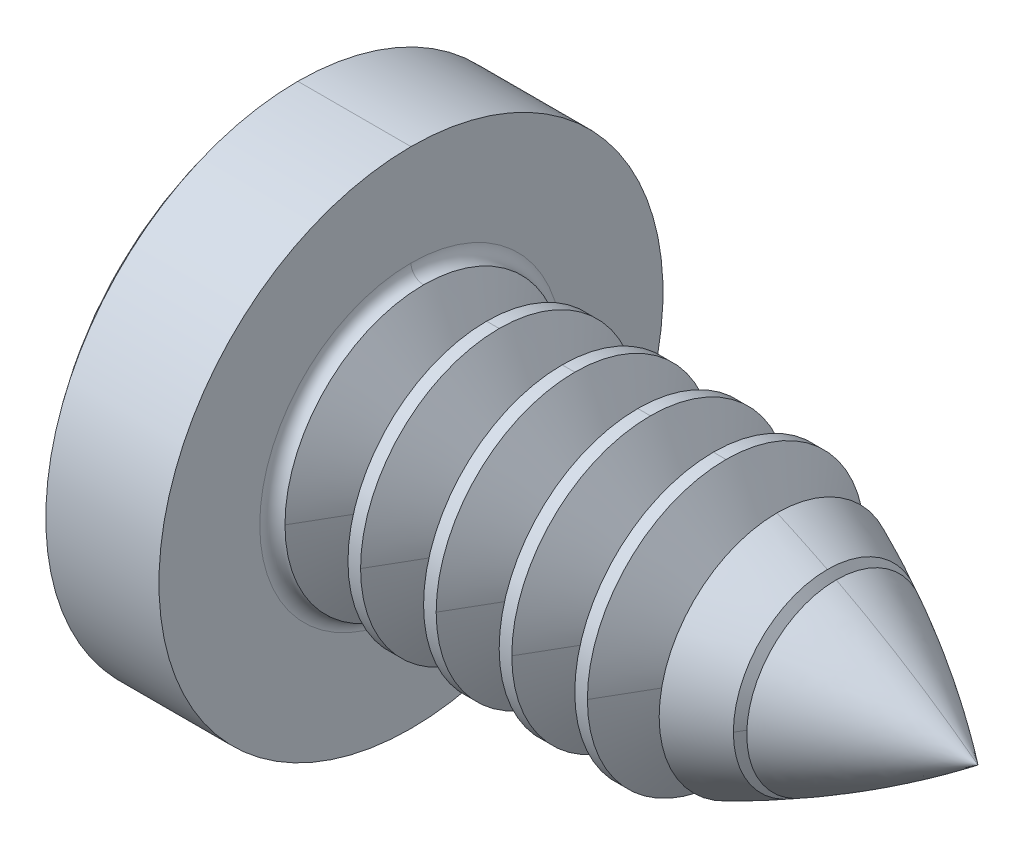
ISO-10303-21;
HEADER;
FILE_DESCRIPTION(('STEP AP214'),'2;1');
FILE_NAME('part.step','',(''),(''),'','','');
FILE_SCHEMA(('AUTOMOTIVE_DESIGN { 1 0 10303 214 1 1 1 1 }'));
ENDSEC;
DATA;
#1=APPLICATION_CONTEXT('core data for automotive mechanical design processes');
#2=APPLICATION_PROTOCOL_DEFINITION('international standard','automotive_design',2000,#1);
#3=PRODUCT_CONTEXT('',#1,'mechanical');
#4=PRODUCT('Part','Part','',(#3));
#5=PRODUCT_RELATED_PRODUCT_CATEGORY('part','',(#4));
#6=PRODUCT_DEFINITION_FORMATION('','',#4);
#7=PRODUCT_DEFINITION_CONTEXT('part definition',#1,'design');
#8=PRODUCT_DEFINITION('design','',#6,#7);
#9=PRODUCT_DEFINITION_SHAPE('','',#8);
#10=(LENGTH_UNIT() NAMED_UNIT(*) SI_UNIT(.MILLI.,.METRE.));
#11=(NAMED_UNIT(*) PLANE_ANGLE_UNIT() SI_UNIT($,.RADIAN.));
#12=(NAMED_UNIT(*) SI_UNIT($,.STERADIAN.) SOLID_ANGLE_UNIT());
#13=UNCERTAINTY_MEASURE_WITH_UNIT(LENGTH_MEASURE(1.E-05),#10,'distance_accuracy_value','');
#14=(GEOMETRIC_REPRESENTATION_CONTEXT(3) GLOBAL_UNCERTAINTY_ASSIGNED_CONTEXT((#13)) GLOBAL_UNIT_ASSIGNED_CONTEXT((#10,
#11,#12)) REPRESENTATION_CONTEXT('',''));
#15=CARTESIAN_POINT('',(0.,0.,0.));
#16=DIRECTION('',(0.,0.,1.));
#17=DIRECTION('',(1.,0.,0.));
#18=AXIS2_PLACEMENT_3D('',#15,#16,#17);
#19=CARTESIAN_POINT('',(4.427378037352,0.,0.));
#20=DIRECTION('',(1.,0.,0.));
#21=DIRECTION('',(0.,0.,-1.));
#22=AXIS2_PLACEMENT_3D('',#19,#20,#21);
#23=CONICAL_SURFACE('',#22,0.8010099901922,1.0471975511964);
#24=CARTESIAN_POINT('',(4.35,0.,0.));
#25=DIRECTION('',(1.,0.,0.));
#26=DIRECTION('',(0.,0.,1.));
#27=AXIS2_PLACEMENT_3D('',#24,#25,#26);
#28=CIRCLE('',#27,0.6669872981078);
#29=CARTESIAN_POINT('',(4.35,0.,0.6669872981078));
#30=VERTEX_POINT('',#29);
#31=CARTESIAN_POINT('',(4.35,0.,-0.6669872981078));
#32=VERTEX_POINT('',#31);
#33=EDGE_CURVE('E433',#30,#32,#28,.T.);
#34=ORIENTED_EDGE('',*,*,#33,.T.);
#35=DIRECTION('',(-0.500000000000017,0.,0.866025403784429));
#36=VECTOR('',#35,1.);
#37=CARTESIAN_POINT('',(4.504756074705,0.,-0.9350326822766));
#38=LINE('',#37,#36);
#39=CARTESIAN_POINT('',(4.504756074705,0.,-0.9350326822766));
#40=VERTEX_POINT('',#39);
#41=EDGE_CURVE('E587',#40,#32,#38,.T.);
#42=ORIENTED_EDGE('',*,*,#41,.F.);
#43=CARTESIAN_POINT('',(4.504756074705,0.,0.));
#44=DIRECTION('',(1.,0.,0.));
#45=DIRECTION('',(0.,-1.,0.));
#46=AXIS2_PLACEMENT_3D('',#43,#44,#45);
#47=CIRCLE('',#46,0.9350326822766);
#48=CARTESIAN_POINT('',(4.504756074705,-0.9350326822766,0.));
#49=VERTEX_POINT('',#48);
#50=EDGE_CURVE('E710',#49,#40,#47,.T.);
#51=ORIENTED_EDGE('',*,*,#50,.F.);
#52=CARTESIAN_POINT('',(4.504756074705,0.,0.));
#53=DIRECTION('',(1.,0.,0.));
#54=DIRECTION('',(0.,0.,1.));
#55=AXIS2_PLACEMENT_3D('',#52,#53,#54);
#56=CIRCLE('',#55,0.9350326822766);
#57=CARTESIAN_POINT('',(4.504756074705,0.,0.9350326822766));
#58=VERTEX_POINT('',#57);
#59=EDGE_CURVE('E417',#58,#49,#56,.T.);
#60=ORIENTED_EDGE('',*,*,#59,.F.);
#61=DIRECTION('',(-0.500000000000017,0.,-0.866025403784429));
#62=VECTOR('',#61,1.);
#63=CARTESIAN_POINT('',(4.504756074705,0.,0.9350326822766));
#64=LINE('',#63,#62);
#65=EDGE_CURVE('E591',#58,#30,#64,.T.);
#66=ORIENTED_EDGE('',*,*,#65,.T.);
#67=EDGE_LOOP('',(#34,#42,#51,#60,#66));
#68=FACE_BOUND('',#67,.T.);
#69=ADVANCED_FACE('F17',(#68),#23,.T.);
#70=CARTESIAN_POINT('',(1.7,0.,0.));
#71=DIRECTION('',(-1.,0.,0.));
#72=DIRECTION('',(0.,-1.,0.));
#73=AXIS2_PLACEMENT_3D('',#70,#71,#72);
#74=TOROIDAL_SURFACE('',#73,1.2,0.1);
#75=CARTESIAN_POINT('',(1.6,0.,0.));
#76=DIRECTION('',(-1.,0.,0.));
#77=DIRECTION('',(0.,-1.,0.));
#78=AXIS2_PLACEMENT_3D('',#75,#76,#77);
#79=CIRCLE('',#78,1.2);
#80=CARTESIAN_POINT('',(1.6,-1.2,0.));
#81=VERTEX_POINT('',#80);
#82=CARTESIAN_POINT('',(1.6,1.2,0.));
#83=VERTEX_POINT('',#82);
#84=EDGE_CURVE('E834',#81,#83,#79,.T.);
#85=ORIENTED_EDGE('',*,*,#84,.F.);
#86=CARTESIAN_POINT('',(1.7,-1.2,0.));
#87=DIRECTION('',(0.,0.,1.));
#88=DIRECTION('',(0.,1.,0.));
#89=AXIS2_PLACEMENT_3D('',#86,#87,#88);
#90=CIRCLE('',#89,0.1);
#91=CARTESIAN_POINT('',(1.7,-1.1,0.));
#92=VERTEX_POINT('',#91);
#93=EDGE_CURVE('E452',#92,#81,#90,.T.);
#94=ORIENTED_EDGE('',*,*,#93,.F.);
#95=CARTESIAN_POINT('',(1.7,0.,0.));
#96=DIRECTION('',(-1.,0.,0.));
#97=DIRECTION('',(0.,-1.,0.));
#98=AXIS2_PLACEMENT_3D('',#95,#96,#97);
#99=CIRCLE('',#98,1.1);
#100=CARTESIAN_POINT('',(1.7,0.,1.1));
#101=VERTEX_POINT('',#100);
#102=EDGE_CURVE('E409',#92,#101,#99,.T.);
#103=ORIENTED_EDGE('',*,*,#102,.T.);
#104=CARTESIAN_POINT('',(1.7,0.,0.));
#105=DIRECTION('',(-1.,0.,0.));
#106=DIRECTION('',(0.,0.,1.));
#107=AXIS2_PLACEMENT_3D('',#104,#105,#106);
#108=CIRCLE('',#107,1.1);
#109=CARTESIAN_POINT('',(1.7,1.1,0.));
#110=VERTEX_POINT('',#109);
#111=EDGE_CURVE('E410',#101,#110,#108,.T.);
#112=ORIENTED_EDGE('',*,*,#111,.T.);
#113=CARTESIAN_POINT('',(1.7,1.2,0.));
#114=DIRECTION('',(0.,0.,-1.));
#115=DIRECTION('',(0.,-1.,0.));
#116=AXIS2_PLACEMENT_3D('',#113,#114,#115);
#117=CIRCLE('',#116,0.1);
#118=EDGE_CURVE('E680',#110,#83,#117,.T.);
#119=ORIENTED_EDGE('',*,*,#118,.T.);
#120=EDGE_LOOP('',(#85,#94,#103,#112,#119));
#121=FACE_BOUND('',#120,.T.);
#122=ADVANCED_FACE('F1031',(#121),#74,.F.);
#123=CARTESIAN_POINT('',(1.2,0.2,-0.2));
#124=DIRECTION('',(-1.,0.,0.));
#125=DIRECTION('',(0.,0.,1.));
#126=AXIS2_PLACEMENT_3D('',#123,#124,#125);
#127=PLANE('',#126);
#128=DIRECTION('',(0.,0.,-1.));
#129=VECTOR('',#128,1.);
#130=CARTESIAN_POINT('',(1.2,0.2,-0.2));
#131=LINE('',#130,#129);
#132=CARTESIAN_POINT('',(1.2,0.2,-0.2));
#133=VERTEX_POINT('',#132);
#134=CARTESIAN_POINT('',(1.2,0.2,-0.3071796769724));
#135=VERTEX_POINT('',#134);
#136=EDGE_CURVE('E445',#133,#135,#131,.T.);
#137=ORIENTED_EDGE('',*,*,#136,.T.);
#138=DIRECTION('',(0.,-1.,0.));
#139=VECTOR('',#138,1.);
#140=CARTESIAN_POINT('',(1.2,0.2,-0.3071796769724));
#141=LINE('',#140,#139);
#142=CARTESIAN_POINT('',(1.2,-0.2,-0.3071796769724));
#143=VERTEX_POINT('',#142);
#144=EDGE_CURVE('E446',#135,#143,#141,.T.);
#145=ORIENTED_EDGE('',*,*,#144,.T.);
#146=DIRECTION('',(0.,0.,1.));
#147=VECTOR('',#146,1.);
#148=CARTESIAN_POINT('',(1.2,-0.2,-0.3071796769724));
#149=LINE('',#148,#147);
#150=CARTESIAN_POINT('',(1.2,-0.2,-0.2));
#151=VERTEX_POINT('',#150);
#152=EDGE_CURVE('E622',#143,#151,#149,.T.);
#153=ORIENTED_EDGE('',*,*,#152,.T.);
#154=DIRECTION('',(0.,-1.,0.));
#155=VECTOR('',#154,1.);
#156=CARTESIAN_POINT('',(1.2,-0.2,-0.2));
#157=LINE('',#156,#155);
#158=CARTESIAN_POINT('',(1.2,-0.3071796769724,-0.2));
#159=VERTEX_POINT('',#158);
#160=EDGE_CURVE('E513',#151,#159,#157,.T.);
#161=ORIENTED_EDGE('',*,*,#160,.T.);
#162=DIRECTION('',(0.,0.,1.));
#163=VECTOR('',#162,1.);
#164=CARTESIAN_POINT('',(1.2,-0.3071796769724,-0.2));
#165=LINE('',#164,#163);
#166=CARTESIAN_POINT('',(1.2,-0.3071796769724,0.2));
#167=VERTEX_POINT('',#166);
#168=EDGE_CURVE('E514',#159,#167,#165,.T.);
#169=ORIENTED_EDGE('',*,*,#168,.T.);
#170=DIRECTION('',(0.,1.,0.));
#171=VECTOR('',#170,1.);
#172=CARTESIAN_POINT('',(1.2,-0.3071796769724,0.2));
#173=LINE('',#172,#171);
#174=CARTESIAN_POINT('',(1.2,-0.2,0.2));
#175=VERTEX_POINT('',#174);
#176=EDGE_CURVE('E11',#167,#175,#173,.T.);
#177=ORIENTED_EDGE('',*,*,#176,.T.);
#178=DIRECTION('',(0.,0.,1.));
#179=VECTOR('',#178,1.);
#180=CARTESIAN_POINT('',(1.2,-0.2,0.2));
#181=LINE('',#180,#179);
#182=CARTESIAN_POINT('',(1.2,-0.2,0.3071796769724));
#183=VERTEX_POINT('',#182);
#184=EDGE_CURVE('E525',#175,#183,#181,.T.);
#185=ORIENTED_EDGE('',*,*,#184,.T.);
#186=DIRECTION('',(0.,1.,0.));
#187=VECTOR('',#186,1.);
#188=CARTESIAN_POINT('',(1.2,-0.2,0.3071796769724));
#189=LINE('',#188,#187);
#190=CARTESIAN_POINT('',(1.2,0.2,0.3071796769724));
#191=VERTEX_POINT('',#190);
#192=EDGE_CURVE('E644',#183,#191,#189,.T.);
#193=ORIENTED_EDGE('',*,*,#192,.T.);
#194=DIRECTION('',(0.,0.,-1.));
#195=VECTOR('',#194,1.);
#196=CARTESIAN_POINT('',(1.2,0.2,0.3071796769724));
#197=LINE('',#196,#195);
#198=CARTESIAN_POINT('',(1.2,0.2,0.2));
#199=VERTEX_POINT('',#198);
#200=EDGE_CURVE('E522',#191,#199,#197,.T.);
#201=ORIENTED_EDGE('',*,*,#200,.T.);
#202=DIRECTION('',(0.,1.,0.));
#203=VECTOR('',#202,1.);
#204=CARTESIAN_POINT('',(1.2,0.2,0.2));
#205=LINE('',#204,#203);
#206=CARTESIAN_POINT('',(1.2,0.3071796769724,0.2));
#207=VERTEX_POINT('',#206);
#208=EDGE_CURVE('E523',#199,#207,#205,.T.);
#209=ORIENTED_EDGE('',*,*,#208,.T.);
#210=DIRECTION('',(0.,0.,-1.));
#211=VECTOR('',#210,1.);
#212=CARTESIAN_POINT('',(1.2,0.3071796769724,0.2));
#213=LINE('',#212,#211);
#214=CARTESIAN_POINT('',(1.2,0.3071796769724,-0.2));
#215=VERTEX_POINT('',#214);
#216=EDGE_CURVE('E468',#207,#215,#213,.T.);
#217=ORIENTED_EDGE('',*,*,#216,.T.);
#218=DIRECTION('',(0.,-1.,0.));
#219=VECTOR('',#218,1.);
#220=CARTESIAN_POINT('',(1.2,0.3071796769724,-0.2));
#221=LINE('',#220,#219);
#222=EDGE_CURVE('E469',#215,#133,#221,.T.);
#223=ORIENTED_EDGE('',*,*,#222,.T.);
#224=EDGE_LOOP('',(#137,#145,#153,#161,#169,#177,#185,#193,#201,#209,#217,#223));
#225=FACE_BOUND('',#224,.T.);
#226=ADVANCED_FACE('F1036',(#225),#127,.T.);
#227=CARTESIAN_POINT('',(1.2,-1.,0.2));
#228=DIRECTION('',(0.,0.,-1.));
#229=DIRECTION('',(0.,-1.,0.));
#230=AXIS2_PLACEMENT_3D('',#227,#228,#229);
#231=PLANE('',#230);
#232=DIRECTION('',(1.,0.,0.));
#233=VECTOR('',#232,1.);
#234=CARTESIAN_POINT('',(0.01252450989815,-0.2,0.2));
#235=LINE('',#234,#233);
#236=CARTESIAN_POINT('',(0.01252450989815,-0.2,0.2));
#237=VERTEX_POINT('',#236);
#238=EDGE_CURVE('E28',#237,#175,#235,.T.);
#239=ORIENTED_EDGE('',*,*,#238,.T.);
#240=ORIENTED_EDGE('',*,*,#176,.F.);
#241=DIRECTION('',(-0.866025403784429,-0.500000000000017,0.));
#242=VECTOR('',#241,1.);
#243=CARTESIAN_POINT('',(1.2,-0.3071796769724,0.2));
#244=LINE('',#243,#242);
#245=CARTESIAN_POINT('',(0.1411804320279,-0.9184894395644,0.2));
#246=VERTEX_POINT('',#245);
#247=EDGE_CURVE('E792',#167,#246,#244,.T.);
#248=ORIENTED_EDGE('',*,*,#247,.T.);
#249=CARTESIAN_POINT('',(3.2,0.,0.2));
#250=DIRECTION('',(0.,0.,-1.));
#251=DIRECTION('',(-0.957753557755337,-0.287590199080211,0.));
#252=AXIS2_PLACEMENT_3D('',#249,#250,#251);
#253=CIRCLE('',#252,3.193743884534);
#254=EDGE_CURVE('E783',#246,#237,#253,.T.);
#255=ORIENTED_EDGE('',*,*,#254,.T.);
#256=EDGE_LOOP('',(#239,#240,#248,#255));
#257=FACE_BOUND('',#256,.T.);
#258=ADVANCED_FACE('F1078',(#257),#231,.T.);
#259=CARTESIAN_POINT('',(1.2,-0.2,0.2));
#260=DIRECTION('',(0.,1.,0.));
#261=DIRECTION('',(1.,0.,0.));
#262=AXIS2_PLACEMENT_3D('',#259,#260,#261);
#263=PLANE('',#262);
#264=DIRECTION('',(0.866025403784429,0.,-0.500000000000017));
#265=VECTOR('',#264,1.);
#266=CARTESIAN_POINT('',(0.1411804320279,-0.2,0.9184894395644));
#267=LINE('',#266,#265);
#268=CARTESIAN_POINT('',(0.1411804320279,-0.2,0.9184894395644));
#269=VERTEX_POINT('',#268);
#270=EDGE_CURVE('E21',#269,#183,#267,.T.);
#271=ORIENTED_EDGE('',*,*,#270,.T.);
#272=ORIENTED_EDGE('',*,*,#184,.F.);
#273=ORIENTED_EDGE('',*,*,#238,.F.);
#274=CARTESIAN_POINT('',(3.2,-0.2,0.));
#275=DIRECTION('',(0.,-1.,0.));
#276=DIRECTION('',(-0.957753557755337,0.,0.287590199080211));
#277=AXIS2_PLACEMENT_3D('',#274,#275,#276);
#278=CIRCLE('',#277,3.193743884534);
#279=EDGE_CURVE('E786',#269,#237,#278,.T.);
#280=ORIENTED_EDGE('',*,*,#279,.F.);
#281=EDGE_LOOP('',(#271,#272,#273,#280));
#282=FACE_BOUND('',#281,.T.);
#283=ADVANCED_FACE('F1095',(#282),#263,.T.);
#284=CARTESIAN_POINT('',(0.,0.,1.));
#285=DIRECTION('',(-0.500000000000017,0.,-0.866025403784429));
#286=DIRECTION('',(-0.866025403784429,0.,0.500000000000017));
#287=AXIS2_PLACEMENT_3D('',#284,#285,#286);
#288=PLANE('',#287);
#289=DIRECTION('',(-0.866025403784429,0.,0.500000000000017));
#290=VECTOR('',#289,1.);
#291=CARTESIAN_POINT('',(1.2,0.2,0.3071796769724));
#292=LINE('',#291,#290);
#293=CARTESIAN_POINT('',(0.1411804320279,0.2,0.9184894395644));
#294=VERTEX_POINT('',#293);
#295=EDGE_CURVE('E647',#191,#294,#292,.T.);
#296=ORIENTED_EDGE('',*,*,#295,.F.);
#297=ORIENTED_EDGE('',*,*,#192,.F.);
#298=ORIENTED_EDGE('',*,*,#270,.F.);
#299=CARTESIAN_POINT('',(2.833012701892,0.,-0.6356406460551));
#300=DIRECTION('',(0.499999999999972,0.,0.866025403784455));
#301=DIRECTION('',(-0.864238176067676,0.0642118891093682,0.498968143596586));
#302=AXIS2_PLACEMENT_3D('',#299,#300,#301);
#303=CIRCLE('',#302,3.114687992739);
#304=EDGE_CURVE('E546',#294,#269,#303,.T.);
#305=ORIENTED_EDGE('',*,*,#304,.F.);
#306=EDGE_LOOP('',(#296,#297,#298,#305));
#307=FACE_BOUND('',#306,.T.);
#308=ADVANCED_FACE('F1204',(#307),#288,.T.);
#309=CARTESIAN_POINT('',(1.2,0.2,0.2));
#310=DIRECTION('',(0.,-1.,0.));
#311=DIRECTION('',(0.,0.,-1.));
#312=AXIS2_PLACEMENT_3D('',#309,#310,#311);
#313=PLANE('',#312);
#314=DIRECTION('',(1.,0.,0.));
#315=VECTOR('',#314,1.);
#316=CARTESIAN_POINT('',(0.01252450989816,0.2,0.2));
#317=LINE('',#316,#315);
#318=CARTESIAN_POINT('',(0.01252450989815,0.2,0.2));
#319=VERTEX_POINT('',#318);
#320=EDGE_CURVE('E519',#319,#199,#317,.T.);
#321=ORIENTED_EDGE('',*,*,#320,.T.);
#322=ORIENTED_EDGE('',*,*,#200,.F.);
#323=ORIENTED_EDGE('',*,*,#295,.T.);
#324=CARTESIAN_POINT('',(3.2,0.2,0.));
#325=DIRECTION('',(0.,1.,0.));
#326=DIRECTION('',(-0.998037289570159,0.,0.0626224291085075));
#327=AXIS2_PLACEMENT_3D('',#324,#325,#326);
#328=CIRCLE('',#327,3.193743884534);
#329=EDGE_CURVE('E542',#319,#294,#328,.T.);
#330=ORIENTED_EDGE('',*,*,#329,.F.);
#331=EDGE_LOOP('',(#321,#322,#323,#330));
#332=FACE_BOUND('',#331,.T.);
#333=ADVANCED_FACE('F1207',(#332),#313,.T.);
#334=CARTESIAN_POINT('',(1.2,1.,0.2));
#335=DIRECTION('',(0.,0.,-1.));
#336=DIRECTION('',(0.,-1.,0.));
#337=AXIS2_PLACEMENT_3D('',#334,#335,#336);
#338=PLANE('',#337);
#339=DIRECTION('',(0.866025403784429,-0.500000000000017,0.));
#340=VECTOR('',#339,1.);
#341=CARTESIAN_POINT('',(0.1411804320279,0.9184894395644,0.2));
#342=LINE('',#341,#340);
#343=CARTESIAN_POINT('',(0.1411804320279,0.9184894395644,0.2));
#344=VERTEX_POINT('',#343);
#345=EDGE_CURVE('E569',#344,#207,#342,.T.);
#346=ORIENTED_EDGE('',*,*,#345,.T.);
#347=ORIENTED_EDGE('',*,*,#208,.F.);
#348=ORIENTED_EDGE('',*,*,#320,.F.);
#349=CARTESIAN_POINT('',(3.2,0.,0.2));
#350=DIRECTION('',(0.,0.,-1.));
#351=DIRECTION('',(-0.998037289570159,0.0626224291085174,0.));
#352=AXIS2_PLACEMENT_3D('',#349,#350,#351);
#353=CIRCLE('',#352,3.193743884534);
#354=EDGE_CURVE('E547',#319,#344,#353,.T.);
#355=ORIENTED_EDGE('',*,*,#354,.T.);
#356=EDGE_LOOP('',(#346,#347,#348,#355));
#357=FACE_BOUND('',#356,.T.);
#358=ADVANCED_FACE('F1041',(#357),#338,.T.);
#359=CARTESIAN_POINT('',(0.,1.,0.));
#360=DIRECTION('',(-0.500000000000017,-0.866025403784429,0.));
#361=DIRECTION('',(-0.866025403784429,0.500000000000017,0.));
#362=AXIS2_PLACEMENT_3D('',#359,#360,#361);
#363=PLANE('',#362);
#364=CARTESIAN_POINT('',(2.833012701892,-0.6356406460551,0.));
#365=DIRECTION('',(0.499999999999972,0.866025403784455,0.));
#366=DIRECTION('',(-0.864238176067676,0.498968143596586,-0.0642118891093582));
#367=AXIS2_PLACEMENT_3D('',#364,#365,#366);
#368=CIRCLE('',#367,3.114687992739);
#369=CARTESIAN_POINT('',(0.1411804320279,0.9184894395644,-0.2));
#370=VERTEX_POINT('',#369);
#371=CARTESIAN_POINT('',(0.1356137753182,0.9217033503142,0.));
#372=VERTEX_POINT('',#371);
#373=EDGE_CURVE('E477',#370,#372,#368,.T.);
#374=ORIENTED_EDGE('',*,*,#373,.F.);
#375=DIRECTION('',(-0.866025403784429,0.500000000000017,0.));
#376=VECTOR('',#375,1.);
#377=CARTESIAN_POINT('',(1.2,0.3071796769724,-0.2));
#378=LINE('',#377,#376);
#379=EDGE_CURVE('E464',#215,#370,#378,.T.);
#380=ORIENTED_EDGE('',*,*,#379,.F.);
#381=ORIENTED_EDGE('',*,*,#216,.F.);
#382=ORIENTED_EDGE('',*,*,#345,.F.);
#383=CARTESIAN_POINT('',(2.833012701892,-0.6356406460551,0.));
#384=DIRECTION('',(0.500000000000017,0.866025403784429,0.));
#385=DIRECTION('',(-0.866025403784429,0.500000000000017,0.));
#386=AXIS2_PLACEMENT_3D('',#383,#384,#385);
#387=CIRCLE('',#386,3.114687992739);
#388=EDGE_CURVE('E559',#372,#344,#387,.T.);
#389=ORIENTED_EDGE('',*,*,#388,.F.);
#390=EDGE_LOOP('',(#374,#380,#381,#382,#389));
#391=FACE_BOUND('',#390,.T.);
#392=ADVANCED_FACE('F872',(#391),#363,.T.);
#393=CARTESIAN_POINT('',(1.2,1.,-0.2));
#394=DIRECTION('',(0.,0.,1.));
#395=DIRECTION('',(1.,0.,0.));
#396=AXIS2_PLACEMENT_3D('',#393,#394,#395);
#397=PLANE('',#396);
#398=DIRECTION('',(1.,0.,0.));
#399=VECTOR('',#398,1.);
#400=CARTESIAN_POINT('',(0.01252450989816,0.2,-0.2));
#401=LINE('',#400,#399);
#402=CARTESIAN_POINT('',(0.01252450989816,0.2,-0.2));
#403=VERTEX_POINT('',#402);
#404=EDGE_CURVE('E683',#403,#133,#401,.T.);
#405=ORIENTED_EDGE('',*,*,#404,.T.);
#406=ORIENTED_EDGE('',*,*,#222,.F.);
#407=ORIENTED_EDGE('',*,*,#379,.T.);
#408=CARTESIAN_POINT('',(3.2,0.,-0.2));
#409=DIRECTION('',(0.,0.,1.));
#410=DIRECTION('',(-0.957753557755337,0.287590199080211,0.));
#411=AXIS2_PLACEMENT_3D('',#408,#409,#410);
#412=CIRCLE('',#411,3.193743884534);
#413=EDGE_CURVE('E439',#370,#403,#412,.T.);
#414=ORIENTED_EDGE('',*,*,#413,.T.);
#415=EDGE_LOOP('',(#405,#406,#407,#414));
#416=FACE_BOUND('',#415,.T.);
#417=ADVANCED_FACE('F1079',(#416),#397,.T.);
#418=CARTESIAN_POINT('',(1.2,0.2,-0.2));
#419=DIRECTION('',(0.,-1.,0.));
#420=DIRECTION('',(0.,0.,-1.));
#421=AXIS2_PLACEMENT_3D('',#418,#419,#420);
#422=PLANE('',#421);
#423=DIRECTION('',(0.866025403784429,0.,0.500000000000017));
#424=VECTOR('',#423,1.);
#425=CARTESIAN_POINT('',(0.1411804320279,0.2,-0.9184894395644));
#426=LINE('',#425,#424);
#427=CARTESIAN_POINT('',(0.1411804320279,0.2,-0.9184894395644));
#428=VERTEX_POINT('',#427);
#429=EDGE_CURVE('E441',#428,#135,#426,.T.);
#430=ORIENTED_EDGE('',*,*,#429,.T.);
#431=ORIENTED_EDGE('',*,*,#136,.F.);
#432=ORIENTED_EDGE('',*,*,#404,.F.);
#433=CARTESIAN_POINT('',(3.2,0.2,0.));
#434=DIRECTION('',(0.,1.,0.));
#435=DIRECTION('',(-0.957753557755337,0.,-0.287590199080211));
#436=AXIS2_PLACEMENT_3D('',#433,#434,#435);
#437=CIRCLE('',#436,3.193743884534);
#438=EDGE_CURVE('E435',#428,#403,#437,.T.);
#439=ORIENTED_EDGE('',*,*,#438,.F.);
#440=EDGE_LOOP('',(#430,#431,#432,#439));
#441=FACE_BOUND('',#440,.T.);
#442=ADVANCED_FACE('F1082',(#441),#422,.T.);
#443=CARTESIAN_POINT('',(0.,0.,-1.));
#444=DIRECTION('',(-0.500000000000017,0.,0.866025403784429));
#445=DIRECTION('',(0.,1.,0.));
#446=AXIS2_PLACEMENT_3D('',#443,#444,#445);
#447=PLANE('',#446);
#448=CARTESIAN_POINT('',(2.833012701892,0.,0.6356406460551));
#449=DIRECTION('',(0.499999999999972,0.,-0.866025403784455));
#450=DIRECTION('',(-0.864238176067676,-0.0642118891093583,-0.498968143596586));
#451=AXIS2_PLACEMENT_3D('',#448,#449,#450);
#452=CIRCLE('',#451,3.114687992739);
#453=CARTESIAN_POINT('',(0.1411804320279,-0.2,-0.9184894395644));
#454=VERTEX_POINT('',#453);
#455=CARTESIAN_POINT('',(0.1356137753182,0.,-0.9217033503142));
#456=VERTEX_POINT('',#455);
#457=EDGE_CURVE('E603',#454,#456,#452,.T.);
#458=ORIENTED_EDGE('',*,*,#457,.F.);
#459=DIRECTION('',(-0.866025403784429,0.,-0.500000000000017));
#460=VECTOR('',#459,1.);
#461=CARTESIAN_POINT('',(1.2,-0.2,-0.3071796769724));
#462=LINE('',#461,#460);
#463=EDGE_CURVE('E625',#143,#454,#462,.T.);
#464=ORIENTED_EDGE('',*,*,#463,.F.);
#465=ORIENTED_EDGE('',*,*,#144,.F.);
#466=ORIENTED_EDGE('',*,*,#429,.F.);
#467=CARTESIAN_POINT('',(2.833012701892,0.,0.6356406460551));
#468=DIRECTION('',(0.500000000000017,0.,-0.866025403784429));
#469=DIRECTION('',(-0.866025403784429,0.,-0.500000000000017));
#470=AXIS2_PLACEMENT_3D('',#467,#468,#469);
#471=CIRCLE('',#470,3.114687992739);
#472=EDGE_CURVE('E440',#456,#428,#471,.T.);
#473=ORIENTED_EDGE('',*,*,#472,.F.);
#474=EDGE_LOOP('',(#458,#464,#465,#466,#473));
#475=FACE_BOUND('',#474,.T.);
#476=ADVANCED_FACE('F1107',(#475),#447,.T.);
#477=CARTESIAN_POINT('',(1.2,-0.2,-0.2));
#478=DIRECTION('',(0.,1.,0.));
#479=DIRECTION('',(1.,0.,0.));
#480=AXIS2_PLACEMENT_3D('',#477,#478,#479);
#481=PLANE('',#480);
#482=DIRECTION('',(1.,0.,0.));
#483=VECTOR('',#482,1.);
#484=CARTESIAN_POINT('',(0.01252450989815,-0.2,-0.2));
#485=LINE('',#484,#483);
#486=CARTESIAN_POINT('',(0.01252450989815,-0.2,-0.2));
#487=VERTEX_POINT('',#486);
#488=EDGE_CURVE('E626',#487,#151,#485,.T.);
#489=ORIENTED_EDGE('',*,*,#488,.T.);
#490=ORIENTED_EDGE('',*,*,#152,.F.);
#491=ORIENTED_EDGE('',*,*,#463,.T.);
#492=CARTESIAN_POINT('',(3.2,-0.2,0.));
#493=DIRECTION('',(0.,-1.,0.));
#494=DIRECTION('',(-0.998037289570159,0.,-0.0626224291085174));
#495=AXIS2_PLACEMENT_3D('',#492,#493,#494);
#496=CIRCLE('',#495,3.193743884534);
#497=EDGE_CURVE('E568',#487,#454,#496,.T.);
#498=ORIENTED_EDGE('',*,*,#497,.F.);
#499=EDGE_LOOP('',(#489,#490,#491,#498));
#500=FACE_BOUND('',#499,.T.);
#501=ADVANCED_FACE('F19',(#500),#481,.T.);
#502=CARTESIAN_POINT('',(1.2,-1.,-0.2));
#503=DIRECTION('',(0.,0.,1.));
#504=DIRECTION('',(1.,0.,0.));
#505=AXIS2_PLACEMENT_3D('',#502,#503,#504);
#506=PLANE('',#505);
#507=DIRECTION('',(0.866025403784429,0.500000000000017,0.));
#508=VECTOR('',#507,1.);
#509=CARTESIAN_POINT('',(0.1411804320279,-0.9184894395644,-0.2));
#510=LINE('',#509,#508);
#511=CARTESIAN_POINT('',(0.1411804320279,-0.9184894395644,-0.2));
#512=VERTEX_POINT('',#511);
#513=EDGE_CURVE('E509',#512,#159,#510,.T.);
#514=ORIENTED_EDGE('',*,*,#513,.T.);
#515=ORIENTED_EDGE('',*,*,#160,.F.);
#516=ORIENTED_EDGE('',*,*,#488,.F.);
#517=CARTESIAN_POINT('',(3.2,0.,-0.2));
#518=DIRECTION('',(0.,0.,1.));
#519=DIRECTION('',(-0.998037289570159,-0.0626224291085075,0.));
#520=AXIS2_PLACEMENT_3D('',#517,#518,#519);
#521=CIRCLE('',#520,3.193743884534);
#522=EDGE_CURVE('E564',#487,#512,#521,.T.);
#523=ORIENTED_EDGE('',*,*,#522,.T.);
#524=EDGE_LOOP('',(#514,#515,#516,#523));
#525=FACE_BOUND('',#524,.T.);
#526=ADVANCED_FACE('F1119',(#525),#506,.T.);
#527=CARTESIAN_POINT('',(0.,-1.,0.));
#528=DIRECTION('',(-0.500000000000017,0.866025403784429,0.));
#529=DIRECTION('',(0.,0.,1.));
#530=AXIS2_PLACEMENT_3D('',#527,#528,#529);
#531=PLANE('',#530);
#532=CARTESIAN_POINT('',(2.833012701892,0.6356406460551,0.));
#533=DIRECTION('',(0.499999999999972,-0.866025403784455,0.));
#534=DIRECTION('',(-0.864238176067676,-0.498968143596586,0.0642118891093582));
#535=AXIS2_PLACEMENT_3D('',#532,#533,#534);
#536=CIRCLE('',#535,3.114687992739);
#537=CARTESIAN_POINT('',(0.1356137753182,-0.9217033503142,0.));
#538=VERTEX_POINT('',#537);
#539=EDGE_CURVE('E402',#246,#538,#536,.T.);
#540=ORIENTED_EDGE('',*,*,#539,.F.);
#541=ORIENTED_EDGE('',*,*,#247,.F.);
#542=ORIENTED_EDGE('',*,*,#168,.F.);
#543=ORIENTED_EDGE('',*,*,#513,.F.);
#544=CARTESIAN_POINT('',(2.833012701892,0.6356406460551,0.));
#545=DIRECTION('',(0.500000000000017,-0.866025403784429,0.));
#546=DIRECTION('',(-0.866025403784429,-0.500000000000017,0.));
#547=AXIS2_PLACEMENT_3D('',#544,#545,#546);
#548=CIRCLE('',#547,3.114687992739);
#549=EDGE_CURVE('E551',#538,#512,#548,.T.);
#550=ORIENTED_EDGE('',*,*,#549,.F.);
#551=EDGE_LOOP('',(#540,#541,#542,#543,#550));
#552=FACE_BOUND('',#551,.T.);
#553=ADVANCED_FACE('F1149',(#552),#531,.T.);
#554=CARTESIAN_POINT('',(3.2,0.,0.));
#555=DIRECTION('',(0.,0.,-1.));
#556=DIRECTION('',(0.,1.,0.));
#557=AXIS2_PLACEMENT_3D('',#554,#555,#556);
#558=SPHERICAL_SURFACE('',#557,3.2);
#559=CARTESIAN_POINT('',(0.7020008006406,0.,0.));
#560=DIRECTION('',(-1.,0.,0.));
#561=DIRECTION('',(0.,-1.,0.));
#562=AXIS2_PLACEMENT_3D('',#559,#560,#561);
#563=CIRCLE('',#562,2.);
#564=CARTESIAN_POINT('',(0.7020008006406,-2.,0.));
#565=VERTEX_POINT('',#564);
#566=CARTESIAN_POINT('',(0.7020008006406,2.,0.));
#567=VERTEX_POINT('',#566);
#568=EDGE_CURVE('E634',#565,#567,#563,.T.);
#569=ORIENTED_EDGE('',*,*,#568,.T.);
#570=CARTESIAN_POINT('',(3.2,0.,0.));
#571=DIRECTION('',(0.,0.,-1.));
#572=DIRECTION('',(-0.957620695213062,0.288032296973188,0.));
#573=AXIS2_PLACEMENT_3D('',#570,#571,#572);
#574=CIRCLE('',#573,3.2);
#575=EDGE_CURVE('E563',#372,#567,#574,.T.);
#576=ORIENTED_EDGE('',*,*,#575,.F.);
#577=ORIENTED_EDGE('',*,*,#388,.T.);
#578=ORIENTED_EDGE('',*,*,#354,.F.);
#579=ORIENTED_EDGE('',*,*,#329,.T.);
#580=ORIENTED_EDGE('',*,*,#304,.T.);
#581=ORIENTED_EDGE('',*,*,#279,.T.);
#582=ORIENTED_EDGE('',*,*,#254,.F.);
#583=ORIENTED_EDGE('',*,*,#539,.T.);
#584=CARTESIAN_POINT('',(3.2,0.,0.));
#585=DIRECTION('',(0.,0.,1.));
#586=DIRECTION('',(-0.957620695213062,-0.288032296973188,0.));
#587=AXIS2_PLACEMENT_3D('',#584,#585,#586);
#588=CIRCLE('',#587,3.2);
#589=EDGE_CURVE('E548',#538,#565,#588,.T.);
#590=ORIENTED_EDGE('',*,*,#589,.T.);
#591=EDGE_LOOP('',(#569,#576,#577,#578,#579,#580,#581,#582,#583,#590));
#592=FACE_BOUND('',#591,.T.);
#593=ADVANCED_FACE('F1140',(#592),#558,.T.);
#594=CARTESIAN_POINT('',(3.2,0.,0.));
#595=DIRECTION('',(0.,0.,-1.));
#596=DIRECTION('',(0.,1.,0.));
#597=AXIS2_PLACEMENT_3D('',#594,#595,#596);
#598=SPHERICAL_SURFACE('',#597,3.2);
#599=ORIENTED_EDGE('',*,*,#589,.F.);
#600=ORIENTED_EDGE('',*,*,#549,.T.);
#601=ORIENTED_EDGE('',*,*,#522,.F.);
#602=ORIENTED_EDGE('',*,*,#497,.T.);
#603=ORIENTED_EDGE('',*,*,#457,.T.);
#604=ORIENTED_EDGE('',*,*,#472,.T.);
#605=ORIENTED_EDGE('',*,*,#438,.T.);
#606=ORIENTED_EDGE('',*,*,#413,.F.);
#607=ORIENTED_EDGE('',*,*,#373,.T.);
#608=ORIENTED_EDGE('',*,*,#575,.T.);
#609=CARTESIAN_POINT('',(0.7020008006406,0.,0.));
#610=DIRECTION('',(-1.,0.,0.));
#611=DIRECTION('',(0.,1.,0.));
#612=AXIS2_PLACEMENT_3D('',#609,#610,#611);
#613=CIRCLE('',#612,2.);
#614=EDGE_CURVE('E552',#567,#565,#613,.T.);
#615=ORIENTED_EDGE('',*,*,#614,.T.);
#616=EDGE_LOOP('',(#599,#600,#601,#602,#603,#604,#605,#606,#607,#608,#615));
#617=FACE_BOUND('',#616,.T.);
#618=ADVANCED_FACE('F867',(#617),#598,.T.);
#619=CARTESIAN_POINT('',(-65.5475361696,0.,0.));
#620=DIRECTION('',(-1.,0.,0.));
#621=DIRECTION('',(0.,-1.,0.));
#622=AXIS2_PLACEMENT_3D('',#619,#620,#621);
#623=CYLINDRICAL_SURFACE('',#622,2.);
#624=CARTESIAN_POINT('',(1.6,0.,0.));
#625=DIRECTION('',(1.,0.,0.));
#626=DIRECTION('',(0.,-1.,0.));
#627=AXIS2_PLACEMENT_3D('',#624,#625,#626);
#628=CIRCLE('',#627,2.);
#629=CARTESIAN_POINT('',(1.6,-2.,0.));
#630=VERTEX_POINT('',#629);
#631=CARTESIAN_POINT('',(1.6,2.,0.));
#632=VERTEX_POINT('',#631);
#633=EDGE_CURVE('E451',#630,#632,#628,.T.);
#634=ORIENTED_EDGE('',*,*,#633,.F.);
#635=DIRECTION('',(1.,0.,0.));
#636=VECTOR('',#635,1.);
#637=CARTESIAN_POINT('',(0.7020008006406,-2.,0.));
#638=LINE('',#637,#636);
#639=EDGE_CURVE('E614',#565,#630,#638,.T.);
#640=ORIENTED_EDGE('',*,*,#639,.F.);
#641=ORIENTED_EDGE('',*,*,#614,.F.);
#642=DIRECTION('',(1.,0.,0.));
#643=VECTOR('',#642,1.);
#644=CARTESIAN_POINT('',(0.7020008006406,2.,0.));
#645=LINE('',#644,#643);
#646=EDGE_CURVE('E638',#567,#632,#645,.T.);
#647=ORIENTED_EDGE('',*,*,#646,.T.);
#648=EDGE_LOOP('',(#634,#640,#641,#647));
#649=FACE_BOUND('',#648,.T.);
#650=ADVANCED_FACE('F1074',(#649),#623,.T.);
#651=CARTESIAN_POINT('',(-65.5475361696,0.,0.));
#652=DIRECTION('',(-1.,0.,0.));
#653=DIRECTION('',(0.,-1.,0.));
#654=AXIS2_PLACEMENT_3D('',#651,#652,#653);
#655=CYLINDRICAL_SURFACE('',#654,2.);
#656=ORIENTED_EDGE('',*,*,#646,.F.);
#657=ORIENTED_EDGE('',*,*,#568,.F.);
#658=ORIENTED_EDGE('',*,*,#639,.T.);
#659=CARTESIAN_POINT('',(1.6,0.,0.));
#660=DIRECTION('',(1.,0.,0.));
#661=DIRECTION('',(0.,1.,0.));
#662=AXIS2_PLACEMENT_3D('',#659,#660,#661);
#663=CIRCLE('',#662,2.);
#664=EDGE_CURVE('E767',#632,#630,#663,.T.);
#665=ORIENTED_EDGE('',*,*,#664,.F.);
#666=EDGE_LOOP('',(#656,#657,#658,#665));
#667=FACE_BOUND('',#666,.T.);
#668=ADVANCED_FACE('F1070',(#667),#655,.T.);
#669=CARTESIAN_POINT('',(1.6,1.1,0.));
#670=DIRECTION('',(-1.,0.,0.));
#671=DIRECTION('',(0.,0.,1.));
#672=AXIS2_PLACEMENT_3D('',#669,#670,#671);
#673=PLANE('',#672);
#674=CARTESIAN_POINT('',(1.6,0.,0.));
#675=DIRECTION('',(-1.,0.,0.));
#676=DIRECTION('',(0.,1.,0.));
#677=AXIS2_PLACEMENT_3D('',#674,#675,#676);
#678=CIRCLE('',#677,1.2);
#679=EDGE_CURVE('E447',#83,#81,#678,.T.);
#680=ORIENTED_EDGE('',*,*,#679,.T.);
#681=ORIENTED_EDGE('',*,*,#84,.T.);
#682=EDGE_LOOP('',(#680,#681));
#683=FACE_BOUND('',#682,.T.);
#684=ORIENTED_EDGE('',*,*,#633,.T.);
#685=ORIENTED_EDGE('',*,*,#664,.T.);
#686=EDGE_LOOP('',(#684,#685));
#687=FACE_BOUND('',#686,.T.);
#688=ADVANCED_FACE('F1073',(#683,#687),#673,.F.);
#689=CARTESIAN_POINT('',(1.7,0.,0.));
#690=DIRECTION('',(-1.,0.,0.));
#691=DIRECTION('',(0.,-1.,0.));
#692=AXIS2_PLACEMENT_3D('',#689,#690,#691);
#693=TOROIDAL_SURFACE('',#692,1.2,0.1);
#694=ORIENTED_EDGE('',*,*,#118,.F.);
#695=CARTESIAN_POINT('',(1.7,0.,0.));
#696=DIRECTION('',(-1.,0.,0.));
#697=DIRECTION('',(0.,1.,0.));
#698=AXIS2_PLACEMENT_3D('',#695,#696,#697);
#699=CIRCLE('',#698,1.1);
#700=CARTESIAN_POINT('',(1.7,0.,-1.1));
#701=VERTEX_POINT('',#700);
#702=EDGE_CURVE('E462',#110,#701,#699,.T.);
#703=ORIENTED_EDGE('',*,*,#702,.T.);
#704=CARTESIAN_POINT('',(1.7,0.,0.));
#705=DIRECTION('',(-1.,0.,0.));
#706=DIRECTION('',(0.,0.,-1.));
#707=AXIS2_PLACEMENT_3D('',#704,#705,#706);
#708=CIRCLE('',#707,1.1);
#709=EDGE_CURVE('E723',#701,#92,#708,.T.);
#710=ORIENTED_EDGE('',*,*,#709,.T.);
#711=ORIENTED_EDGE('',*,*,#93,.T.);
#712=ORIENTED_EDGE('',*,*,#679,.F.);
#713=EDGE_LOOP('',(#694,#703,#710,#711,#712));
#714=FACE_BOUND('',#713,.T.);
#715=ADVANCED_FACE('F1198',(#714),#693,.F.);
#716=CARTESIAN_POINT('',(1.825,0.,0.));
#717=DIRECTION('',(-1.,0.,0.));
#718=DIRECTION('',(0.,0.,1.));
#719=AXIS2_PLACEMENT_3D('',#716,#717,#718);
#720=CONICAL_SURFACE('',#719,0.8834936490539,1.0471975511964);
#721=CARTESIAN_POINT('',(1.95,0.,0.));
#722=DIRECTION('',(1.,0.,0.));
#723=DIRECTION('',(0.,0.,1.));
#724=AXIS2_PLACEMENT_3D('',#721,#722,#723);
#725=CIRCLE('',#724,0.6669872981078);
#726=CARTESIAN_POINT('',(1.95,0.,0.6669872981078));
#727=VERTEX_POINT('',#726);
#728=CARTESIAN_POINT('',(1.95,0.,-0.6669872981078));
#729=VERTEX_POINT('',#728);
#730=EDGE_CURVE('E777',#727,#729,#725,.T.);
#731=ORIENTED_EDGE('',*,*,#730,.F.);
#732=DIRECTION('',(0.500000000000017,0.,-0.866025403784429));
#733=VECTOR('',#732,1.);
#734=CARTESIAN_POINT('',(1.7,0.,1.1));
#735=LINE('',#734,#733);
#736=EDGE_CURVE('E406',#101,#727,#735,.T.);
#737=ORIENTED_EDGE('',*,*,#736,.F.);
#738=ORIENTED_EDGE('',*,*,#102,.F.);
#739=ORIENTED_EDGE('',*,*,#709,.F.);
#740=DIRECTION('',(0.500000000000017,0.,0.866025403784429));
#741=VECTOR('',#740,1.);
#742=CARTESIAN_POINT('',(1.7,0.,-1.1));
#743=LINE('',#742,#741);
#744=EDGE_CURVE('E459',#701,#729,#743,.T.);
#745=ORIENTED_EDGE('',*,*,#744,.T.);
#746=EDGE_LOOP('',(#731,#737,#738,#739,#745));
#747=FACE_BOUND('',#746,.T.);
#748=ADVANCED_FACE('F1160',(#747),#720,.T.);
#749=CARTESIAN_POINT('',(1.825,0.,0.));
#750=DIRECTION('',(-1.,0.,0.));
#751=DIRECTION('',(0.,0.,1.));
#752=AXIS2_PLACEMENT_3D('',#749,#750,#751);
#753=CONICAL_SURFACE('',#752,0.8834936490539,1.0471975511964);
#754=ORIENTED_EDGE('',*,*,#744,.F.);
#755=ORIENTED_EDGE('',*,*,#702,.F.);
#756=ORIENTED_EDGE('',*,*,#111,.F.);
#757=ORIENTED_EDGE('',*,*,#736,.T.);
#758=CARTESIAN_POINT('',(1.95,0.,0.));
#759=DIRECTION('',(1.,0.,0.));
#760=DIRECTION('',(0.,0.,-1.));
#761=AXIS2_PLACEMENT_3D('',#758,#759,#760);
#762=CIRCLE('',#761,0.6669872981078);
#763=EDGE_CURVE('E463',#729,#727,#762,.T.);
#764=ORIENTED_EDGE('',*,*,#763,.F.);
#765=EDGE_LOOP('',(#754,#755,#756,#757,#764));
#766=FACE_BOUND('',#765,.T.);
#767=ADVANCED_FACE('F1193',(#766),#753,.T.);
#768=CARTESIAN_POINT('',(2.075,0.,0.));
#769=DIRECTION('',(1.,0.,0.));
#770=DIRECTION('',(0.,0.,-1.));
#771=AXIS2_PLACEMENT_3D('',#768,#769,#770);
#772=CONICAL_SURFACE('',#771,0.8834936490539,1.0471975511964);
#773=DIRECTION('',(-0.500000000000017,0.,-0.866025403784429));
#774=VECTOR('',#773,1.);
#775=CARTESIAN_POINT('',(2.2,0.,1.1));
#776=LINE('',#775,#774);
#777=CARTESIAN_POINT('',(2.2,0.,1.1));
#778=VERTEX_POINT('',#777);
#779=EDGE_CURVE('E690',#778,#727,#776,.T.);
#780=ORIENTED_EDGE('',*,*,#779,.F.);
#781=CARTESIAN_POINT('',(2.2,0.,0.));
#782=DIRECTION('',(-1.,0.,0.));
#783=DIRECTION('',(0.,0.,1.));
#784=AXIS2_PLACEMENT_3D('',#781,#782,#783);
#785=CIRCLE('',#784,1.1);
#786=CARTESIAN_POINT('',(2.2,1.1,0.));
#787=VERTEX_POINT('',#786);
#788=EDGE_CURVE('E658',#778,#787,#785,.T.);
#789=ORIENTED_EDGE('',*,*,#788,.T.);
#790=CARTESIAN_POINT('',(2.2,0.,0.));
#791=DIRECTION('',(-1.,0.,0.));
#792=DIRECTION('',(0.,1.,0.));
#793=AXIS2_PLACEMENT_3D('',#790,#791,#792);
#794=CIRCLE('',#793,1.1);
#795=CARTESIAN_POINT('',(2.2,0.,-1.1));
#796=VERTEX_POINT('',#795);
#797=EDGE_CURVE('E643',#787,#796,#794,.T.);
#798=ORIENTED_EDGE('',*,*,#797,.T.);
#799=DIRECTION('',(-0.500000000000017,0.,0.866025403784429));
#800=VECTOR('',#799,1.);
#801=CARTESIAN_POINT('',(2.2,0.,-1.1));
#802=LINE('',#801,#800);
#803=EDGE_CURVE('E781',#796,#729,#802,.T.);
#804=ORIENTED_EDGE('',*,*,#803,.T.);
#805=ORIENTED_EDGE('',*,*,#763,.T.);
#806=EDGE_LOOP('',(#780,#789,#798,#804,#805));
#807=FACE_BOUND('',#806,.T.);
#808=ADVANCED_FACE('F1196',(#807),#772,.T.);
#809=CARTESIAN_POINT('',(2.075,0.,0.));
#810=DIRECTION('',(1.,0.,0.));
#811=DIRECTION('',(0.,0.,-1.));
#812=AXIS2_PLACEMENT_3D('',#809,#810,#811);
#813=CONICAL_SURFACE('',#812,0.8834936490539,1.0471975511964);
#814=ORIENTED_EDGE('',*,*,#730,.T.);
#815=ORIENTED_EDGE('',*,*,#803,.F.);
#816=CARTESIAN_POINT('',(2.2,0.,0.));
#817=DIRECTION('',(-1.,0.,0.));
#818=DIRECTION('',(0.,0.,-1.));
#819=AXIS2_PLACEMENT_3D('',#816,#817,#818);
#820=CIRCLE('',#819,1.1);
#821=CARTESIAN_POINT('',(2.2,-1.1,0.));
#822=VERTEX_POINT('',#821);
#823=EDGE_CURVE('E639',#796,#822,#820,.T.);
#824=ORIENTED_EDGE('',*,*,#823,.T.);
#825=CARTESIAN_POINT('',(2.2,0.,0.));
#826=DIRECTION('',(-1.,0.,0.));
#827=DIRECTION('',(0.,-1.,0.));
#828=AXIS2_PLACEMENT_3D('',#825,#826,#827);
#829=CIRCLE('',#828,1.1);
#830=EDGE_CURVE('E661',#822,#778,#829,.T.);
#831=ORIENTED_EDGE('',*,*,#830,.T.);
#832=ORIENTED_EDGE('',*,*,#779,.T.);
#833=EDGE_LOOP('',(#814,#815,#824,#831,#832));
#834=FACE_BOUND('',#833,.T.);
#835=ADVANCED_FACE('F1209',(#834),#813,.T.);
#836=CARTESIAN_POINT('',(-65.5475361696,0.,0.));
#837=DIRECTION('',(-1.,0.,0.));
#838=DIRECTION('',(0.,-1.,0.));
#839=AXIS2_PLACEMENT_3D('',#836,#837,#838);
#840=CYLINDRICAL_SURFACE('',#839,1.1);
#841=CARTESIAN_POINT('',(2.3,0.,0.));
#842=DIRECTION('',(1.,0.,0.));
#843=DIRECTION('',(0.,1.,0.));
#844=AXIS2_PLACEMENT_3D('',#841,#842,#843);
#845=CIRCLE('',#844,1.1);
#846=CARTESIAN_POINT('',(2.3,1.1,0.));
#847=VERTEX_POINT('',#846);
#848=CARTESIAN_POINT('',(2.3,0.,1.1));
#849=VERTEX_POINT('',#848);
#850=EDGE_CURVE('E453',#847,#849,#845,.T.);
#851=ORIENTED_EDGE('',*,*,#850,.F.);
#852=DIRECTION('',(1.,0.,0.));
#853=VECTOR('',#852,1.);
#854=CARTESIAN_POINT('',(2.2,1.1,0.));
#855=LINE('',#854,#853);
#856=EDGE_CURVE('E662',#787,#847,#855,.T.);
#857=ORIENTED_EDGE('',*,*,#856,.F.);
#858=ORIENTED_EDGE('',*,*,#788,.F.);
#859=ORIENTED_EDGE('',*,*,#830,.F.);
#860=DIRECTION('',(1.,0.,0.));
#861=VECTOR('',#860,1.);
#862=CARTESIAN_POINT('',(2.2,-1.1,0.));
#863=LINE('',#862,#861);
#864=CARTESIAN_POINT('',(2.3,-1.1,0.));
#865=VERTEX_POINT('',#864);
#866=EDGE_CURVE('E633',#822,#865,#863,.T.);
#867=ORIENTED_EDGE('',*,*,#866,.T.);
#868=CARTESIAN_POINT('',(2.3,0.,0.));
#869=DIRECTION('',(1.,0.,0.));
#870=DIRECTION('',(0.,0.,1.));
#871=AXIS2_PLACEMENT_3D('',#868,#869,#870);
#872=CIRCLE('',#871,1.1);
#873=EDGE_CURVE('E594',#849,#865,#872,.T.);
#874=ORIENTED_EDGE('',*,*,#873,.F.);
#875=EDGE_LOOP('',(#851,#857,#858,#859,#867,#874));
#876=FACE_BOUND('',#875,.T.);
#877=ADVANCED_FACE('F1103',(#876),#840,.T.);
#878=CARTESIAN_POINT('',(-65.5475361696,0.,0.));
#879=DIRECTION('',(-1.,0.,0.));
#880=DIRECTION('',(0.,-1.,0.));
#881=AXIS2_PLACEMENT_3D('',#878,#879,#880);
#882=CYLINDRICAL_SURFACE('',#881,1.1);
#883=CARTESIAN_POINT('',(2.3,0.,0.));
#884=DIRECTION('',(1.,0.,0.));
#885=DIRECTION('',(0.,0.,-1.));
#886=AXIS2_PLACEMENT_3D('',#883,#884,#885);
#887=CIRCLE('',#886,1.1);
#888=CARTESIAN_POINT('',(2.3,0.,-1.1));
#889=VERTEX_POINT('',#888);
#890=EDGE_CURVE('E458',#889,#847,#887,.T.);
#891=ORIENTED_EDGE('',*,*,#890,.F.);
#892=CARTESIAN_POINT('',(2.3,0.,0.));
#893=DIRECTION('',(1.,0.,0.));
#894=DIRECTION('',(0.,-1.,0.));
#895=AXIS2_PLACEMENT_3D('',#892,#893,#894);
#896=CIRCLE('',#895,1.1);
#897=EDGE_CURVE('E630',#865,#889,#896,.T.);
#898=ORIENTED_EDGE('',*,*,#897,.F.);
#899=ORIENTED_EDGE('',*,*,#866,.F.);
#900=ORIENTED_EDGE('',*,*,#823,.F.);
#901=ORIENTED_EDGE('',*,*,#797,.F.);
#902=ORIENTED_EDGE('',*,*,#856,.T.);
#903=EDGE_LOOP('',(#891,#898,#899,#900,#901,#902));
#904=FACE_BOUND('',#903,.T.);
#905=ADVANCED_FACE('F1101',(#904),#882,.T.);
#906=CARTESIAN_POINT('',(2.425,0.,0.));
#907=DIRECTION('',(-1.,0.,0.));
#908=DIRECTION('',(0.,0.,1.));
#909=AXIS2_PLACEMENT_3D('',#906,#907,#908);
#910=CONICAL_SURFACE('',#909,0.8834936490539,1.0471975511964);
#911=CARTESIAN_POINT('',(2.55,0.,0.));
#912=DIRECTION('',(1.,0.,0.));
#913=DIRECTION('',(0.,0.,1.));
#914=AXIS2_PLACEMENT_3D('',#911,#912,#913);
#915=CIRCLE('',#914,0.6669872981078);
#916=CARTESIAN_POINT('',(2.55,0.,0.6669872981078));
#917=VERTEX_POINT('',#916);
#918=CARTESIAN_POINT('',(2.55,0.,-0.6669872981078));
#919=VERTEX_POINT('',#918);
#920=EDGE_CURVE('E416',#917,#919,#915,.T.);
#921=ORIENTED_EDGE('',*,*,#920,.F.);
#922=DIRECTION('',(0.500000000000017,0.,-0.866025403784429));
#923=VECTOR('',#922,1.);
#924=CARTESIAN_POINT('',(2.3,0.,1.1));
#925=LINE('',#924,#923);
#926=EDGE_CURVE('E457',#849,#917,#925,.T.);
#927=ORIENTED_EDGE('',*,*,#926,.F.);
#928=ORIENTED_EDGE('',*,*,#873,.T.);
#929=ORIENTED_EDGE('',*,*,#897,.T.);
#930=DIRECTION('',(0.500000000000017,0.,0.866025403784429));
#931=VECTOR('',#930,1.);
#932=CARTESIAN_POINT('',(2.3,0.,-1.1));
#933=LINE('',#932,#931);
#934=EDGE_CURVE('E518',#889,#919,#933,.T.);
#935=ORIENTED_EDGE('',*,*,#934,.T.);
#936=EDGE_LOOP('',(#921,#927,#928,#929,#935));
#937=FACE_BOUND('',#936,.T.);
#938=ADVANCED_FACE('F957',(#937),#910,.T.);
#939=CARTESIAN_POINT('',(2.425,0.,0.));
#940=DIRECTION('',(-1.,0.,0.));
#941=DIRECTION('',(0.,0.,1.));
#942=AXIS2_PLACEMENT_3D('',#939,#940,#941);
#943=CONICAL_SURFACE('',#942,0.8834936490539,1.0471975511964);
#944=ORIENTED_EDGE('',*,*,#934,.F.);
#945=ORIENTED_EDGE('',*,*,#890,.T.);
#946=ORIENTED_EDGE('',*,*,#850,.T.);
#947=ORIENTED_EDGE('',*,*,#926,.T.);
#948=CARTESIAN_POINT('',(2.55,0.,0.));
#949=DIRECTION('',(1.,0.,0.));
#950=DIRECTION('',(0.,0.,-1.));
#951=AXIS2_PLACEMENT_3D('',#948,#949,#950);
#952=CIRCLE('',#951,0.6669872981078);
#953=EDGE_CURVE('E473',#919,#917,#952,.T.);
#954=ORIENTED_EDGE('',*,*,#953,.F.);
#955=EDGE_LOOP('',(#944,#945,#946,#947,#954));
#956=FACE_BOUND('',#955,.T.);
#957=ADVANCED_FACE('F964',(#956),#943,.T.);
#958=CARTESIAN_POINT('',(2.675,0.,0.));
#959=DIRECTION('',(1.,0.,0.));
#960=DIRECTION('',(0.,0.,-1.));
#961=AXIS2_PLACEMENT_3D('',#958,#959,#960);
#962=CONICAL_SURFACE('',#961,0.8834936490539,1.0471975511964);
#963=DIRECTION('',(-0.500000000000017,0.,-0.866025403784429));
#964=VECTOR('',#963,1.);
#965=CARTESIAN_POINT('',(2.8,0.,1.1));
#966=LINE('',#965,#964);
#967=CARTESIAN_POINT('',(2.8,0.,1.1));
#968=VERTEX_POINT('',#967);
#969=EDGE_CURVE('E415',#968,#917,#966,.T.);
#970=ORIENTED_EDGE('',*,*,#969,.F.);
#971=CARTESIAN_POINT('',(2.8,0.,0.));
#972=DIRECTION('',(-1.,0.,0.));
#973=DIRECTION('',(0.,0.,1.));
#974=AXIS2_PLACEMENT_3D('',#971,#972,#973);
#975=CIRCLE('',#974,1.1);
#976=CARTESIAN_POINT('',(2.8,1.1,0.));
#977=VERTEX_POINT('',#976);
#978=EDGE_CURVE('E654',#968,#977,#975,.T.);
#979=ORIENTED_EDGE('',*,*,#978,.T.);
#980=CARTESIAN_POINT('',(2.8,0.,0.));
#981=DIRECTION('',(-1.,0.,0.));
#982=DIRECTION('',(0.,1.,0.));
#983=AXIS2_PLACEMENT_3D('',#980,#981,#982);
#984=CIRCLE('',#983,1.1);
#985=CARTESIAN_POINT('',(2.8,0.,-1.1));
#986=VERTEX_POINT('',#985);
#987=EDGE_CURVE('E670',#977,#986,#984,.T.);
#988=ORIENTED_EDGE('',*,*,#987,.T.);
#989=DIRECTION('',(-0.500000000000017,0.,0.866025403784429));
#990=VECTOR('',#989,1.);
#991=CARTESIAN_POINT('',(2.8,0.,-1.1));
#992=LINE('',#991,#990);
#993=EDGE_CURVE('E411',#986,#919,#992,.T.);
#994=ORIENTED_EDGE('',*,*,#993,.T.);
#995=ORIENTED_EDGE('',*,*,#953,.T.);
#996=EDGE_LOOP('',(#970,#979,#988,#994,#995));
#997=FACE_BOUND('',#996,.T.);
#998=ADVANCED_FACE('F966',(#997),#962,.T.);
#999=CARTESIAN_POINT('',(2.675,0.,0.));
#1000=DIRECTION('',(1.,0.,0.));
#1001=DIRECTION('',(0.,0.,-1.));
#1002=AXIS2_PLACEMENT_3D('',#999,#1000,#1001);
#1003=CONICAL_SURFACE('',#1002,0.8834936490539,1.0471975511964);
#1004=ORIENTED_EDGE('',*,*,#920,.T.);
#1005=ORIENTED_EDGE('',*,*,#993,.F.);
#1006=CARTESIAN_POINT('',(2.8,0.,0.));
#1007=DIRECTION('',(-1.,0.,0.));
#1008=DIRECTION('',(0.,0.,-1.));
#1009=AXIS2_PLACEMENT_3D('',#1006,#1007,#1008);
#1010=CIRCLE('',#1009,1.1);
#1011=CARTESIAN_POINT('',(2.8,-1.1,0.));
#1012=VERTEX_POINT('',#1011);
#1013=EDGE_CURVE('E666',#986,#1012,#1010,.T.);
#1014=ORIENTED_EDGE('',*,*,#1013,.T.);
#1015=CARTESIAN_POINT('',(2.8,0.,0.));
#1016=DIRECTION('',(-1.,0.,0.));
#1017=DIRECTION('',(0.,-1.,0.));
#1018=AXIS2_PLACEMENT_3D('',#1015,#1016,#1017);
#1019=CIRCLE('',#1018,1.1);
#1020=EDGE_CURVE('E657',#1012,#968,#1019,.T.);
#1021=ORIENTED_EDGE('',*,*,#1020,.T.);
#1022=ORIENTED_EDGE('',*,*,#969,.T.);
#1023=EDGE_LOOP('',(#1004,#1005,#1014,#1021,#1022));
#1024=FACE_BOUND('',#1023,.T.);
#1025=ADVANCED_FACE('F969',(#1024),#1003,.T.);
#1026=CARTESIAN_POINT('',(-65.5475361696,0.,0.));
#1027=DIRECTION('',(-1.,0.,0.));
#1028=DIRECTION('',(0.,-1.,0.));
#1029=AXIS2_PLACEMENT_3D('',#1026,#1027,#1028);
#1030=CYLINDRICAL_SURFACE('',#1029,1.1);
#1031=CARTESIAN_POINT('',(2.9,0.,0.));
#1032=DIRECTION('',(1.,0.,0.));
#1033=DIRECTION('',(0.,1.,0.));
#1034=AXIS2_PLACEMENT_3D('',#1031,#1032,#1033);
#1035=CIRCLE('',#1034,1.1);
#1036=CARTESIAN_POINT('',(2.9,1.1,0.));
#1037=VERTEX_POINT('',#1036);
#1038=CARTESIAN_POINT('',(2.9,0.,1.1));
#1039=VERTEX_POINT('',#1038);
#1040=EDGE_CURVE('E386',#1037,#1039,#1035,.T.);
#1041=ORIENTED_EDGE('',*,*,#1040,.F.);
#1042=DIRECTION('',(1.,0.,0.));
#1043=VECTOR('',#1042,1.);
#1044=CARTESIAN_POINT('',(2.8,1.1,0.));
#1045=LINE('',#1044,#1043);
#1046=EDGE_CURVE('E381',#977,#1037,#1045,.T.);
#1047=ORIENTED_EDGE('',*,*,#1046,.F.);
#1048=ORIENTED_EDGE('',*,*,#978,.F.);
#1049=ORIENTED_EDGE('',*,*,#1020,.F.);
#1050=DIRECTION('',(1.,0.,0.));
#1051=VECTOR('',#1050,1.);
#1052=CARTESIAN_POINT('',(2.8,-1.1,0.));
#1053=LINE('',#1052,#1051);
#1054=CARTESIAN_POINT('',(2.9,-1.1,0.));
#1055=VERTEX_POINT('',#1054);
#1056=EDGE_CURVE('E374',#1012,#1055,#1053,.T.);
#1057=ORIENTED_EDGE('',*,*,#1056,.T.);
#1058=CARTESIAN_POINT('',(2.9,0.,0.));
#1059=DIRECTION('',(1.,0.,0.));
#1060=DIRECTION('',(0.,0.,1.));
#1061=AXIS2_PLACEMENT_3D('',#1058,#1059,#1060);
#1062=CIRCLE('',#1061,1.1);
#1063=EDGE_CURVE('E370',#1039,#1055,#1062,.T.);
#1064=ORIENTED_EDGE('',*,*,#1063,.F.);
#1065=EDGE_LOOP('',(#1041,#1047,#1048,#1049,#1057,#1064));
#1066=FACE_BOUND('',#1065,.T.);
#1067=ADVANCED_FACE('F1066',(#1066),#1030,.T.);
#1068=CARTESIAN_POINT('',(-65.5475361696,0.,0.));
#1069=DIRECTION('',(-1.,0.,0.));
#1070=DIRECTION('',(0.,-1.,0.));
#1071=AXIS2_PLACEMENT_3D('',#1068,#1069,#1070);
#1072=CYLINDRICAL_SURFACE('',#1071,1.1);
#1073=CARTESIAN_POINT('',(2.9,0.,0.));
#1074=DIRECTION('',(1.,0.,0.));
#1075=DIRECTION('',(0.,0.,-1.));
#1076=AXIS2_PLACEMENT_3D('',#1073,#1074,#1075);
#1077=CIRCLE('',#1076,1.1);
#1078=CARTESIAN_POINT('',(2.9,0.,-1.1));
#1079=VERTEX_POINT('',#1078);
#1080=EDGE_CURVE('E377',#1079,#1037,#1077,.T.);
#1081=ORIENTED_EDGE('',*,*,#1080,.F.);
#1082=CARTESIAN_POINT('',(2.9,0.,0.));
#1083=DIRECTION('',(1.,0.,0.));
#1084=DIRECTION('',(0.,-1.,0.));
#1085=AXIS2_PLACEMENT_3D('',#1082,#1083,#1084);
#1086=CIRCLE('',#1085,1.1);
#1087=EDGE_CURVE('E361',#1055,#1079,#1086,.T.);
#1088=ORIENTED_EDGE('',*,*,#1087,.F.);
#1089=ORIENTED_EDGE('',*,*,#1056,.F.);
#1090=ORIENTED_EDGE('',*,*,#1013,.F.);
#1091=ORIENTED_EDGE('',*,*,#987,.F.);
#1092=ORIENTED_EDGE('',*,*,#1046,.T.);
#1093=EDGE_LOOP('',(#1081,#1088,#1089,#1090,#1091,#1092));
#1094=FACE_BOUND('',#1093,.T.);
#1095=ADVANCED_FACE('F378',(#1094),#1072,.T.);
#1096=CARTESIAN_POINT('',(3.025,0.,0.));
#1097=DIRECTION('',(-1.,0.,0.));
#1098=DIRECTION('',(0.,0.,1.));
#1099=AXIS2_PLACEMENT_3D('',#1096,#1097,#1098);
#1100=CONICAL_SURFACE('',#1099,0.8834936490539,1.0471975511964);
#1101=CARTESIAN_POINT('',(3.15,0.,0.));
#1102=DIRECTION('',(1.,0.,0.));
#1103=DIRECTION('',(0.,0.,1.));
#1104=AXIS2_PLACEMENT_3D('',#1101,#1102,#1103);
#1105=CIRCLE('',#1104,0.6669872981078);
#1106=CARTESIAN_POINT('',(3.15,0.,0.6669872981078));
#1107=VERTEX_POINT('',#1106);
#1108=CARTESIAN_POINT('',(3.15,0.,-0.6669872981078));
#1109=VERTEX_POINT('',#1108);
#1110=EDGE_CURVE('E557',#1107,#1109,#1105,.T.);
#1111=ORIENTED_EDGE('',*,*,#1110,.F.);
#1112=DIRECTION('',(0.500000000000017,0.,-0.866025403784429));
#1113=VECTOR('',#1112,1.);
#1114=CARTESIAN_POINT('',(2.9,0.,1.1));
#1115=LINE('',#1114,#1113);
#1116=EDGE_CURVE('E405',#1039,#1107,#1115,.T.);
#1117=ORIENTED_EDGE('',*,*,#1116,.F.);
#1118=ORIENTED_EDGE('',*,*,#1063,.T.);
#1119=ORIENTED_EDGE('',*,*,#1087,.T.);
#1120=DIRECTION('',(0.500000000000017,0.,0.866025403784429));
#1121=VECTOR('',#1120,1.);
#1122=CARTESIAN_POINT('',(2.9,0.,-1.1));
#1123=LINE('',#1122,#1121);
#1124=EDGE_CURVE('E366',#1079,#1109,#1123,.T.);
#1125=ORIENTED_EDGE('',*,*,#1124,.T.);
#1126=EDGE_LOOP('',(#1111,#1117,#1118,#1119,#1125));
#1127=FACE_BOUND('',#1126,.T.);
#1128=ADVANCED_FACE('F364',(#1127),#1100,.T.);
#1129=CARTESIAN_POINT('',(3.025,0.,0.));
#1130=DIRECTION('',(-1.,0.,0.));
#1131=DIRECTION('',(0.,0.,1.));
#1132=AXIS2_PLACEMENT_3D('',#1129,#1130,#1131);
#1133=CONICAL_SURFACE('',#1132,0.8834936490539,1.0471975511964);
#1134=ORIENTED_EDGE('',*,*,#1124,.F.);
#1135=ORIENTED_EDGE('',*,*,#1080,.T.);
#1136=ORIENTED_EDGE('',*,*,#1040,.T.);
#1137=ORIENTED_EDGE('',*,*,#1116,.T.);
#1138=CARTESIAN_POINT('',(3.15,0.,0.));
#1139=DIRECTION('',(1.,0.,0.));
#1140=DIRECTION('',(0.,0.,-1.));
#1141=AXIS2_PLACEMENT_3D('',#1138,#1139,#1140);
#1142=CIRCLE('',#1141,0.6669872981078);
#1143=EDGE_CURVE('E390',#1109,#1107,#1142,.T.);
#1144=ORIENTED_EDGE('',*,*,#1143,.F.);
#1145=EDGE_LOOP('',(#1134,#1135,#1136,#1137,#1144));
#1146=FACE_BOUND('',#1145,.T.);
#1147=ADVANCED_FACE('F388',(#1146),#1133,.T.);
#1148=CARTESIAN_POINT('',(3.275,0.,0.));
#1149=DIRECTION('',(1.,0.,0.));
#1150=DIRECTION('',(0.,0.,-1.));
#1151=AXIS2_PLACEMENT_3D('',#1148,#1149,#1150);
#1152=CONICAL_SURFACE('',#1151,0.8834936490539,1.0471975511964);
#1153=DIRECTION('',(-0.500000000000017,0.,-0.866025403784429));
#1154=VECTOR('',#1153,1.);
#1155=CARTESIAN_POINT('',(3.4,0.,1.1));
#1156=LINE('',#1155,#1154);
#1157=CARTESIAN_POINT('',(3.4,0.,1.1));
#1158=VERTEX_POINT('',#1157);
#1159=EDGE_CURVE('E398',#1158,#1107,#1156,.T.);
#1160=ORIENTED_EDGE('',*,*,#1159,.F.);
#1161=CARTESIAN_POINT('',(3.4,0.,0.));
#1162=DIRECTION('',(-1.,0.,0.));
#1163=DIRECTION('',(0.,0.,1.));
#1164=AXIS2_PLACEMENT_3D('',#1161,#1162,#1163);
#1165=CIRCLE('',#1164,1.1);
#1166=CARTESIAN_POINT('',(3.4,1.1,0.));
#1167=VERTEX_POINT('',#1166);
#1168=EDGE_CURVE('E558',#1158,#1167,#1165,.T.);
#1169=ORIENTED_EDGE('',*,*,#1168,.T.);
#1170=CARTESIAN_POINT('',(3.4,0.,0.));
#1171=DIRECTION('',(-1.,0.,0.));
#1172=DIRECTION('',(0.,1.,0.));
#1173=AXIS2_PLACEMENT_3D('',#1170,#1171,#1172);
#1174=CIRCLE('',#1173,1.1);
#1175=CARTESIAN_POINT('',(3.4,0.,-1.1));
#1176=VERTEX_POINT('',#1175);
#1177=EDGE_CURVE('E739',#1167,#1176,#1174,.T.);
#1178=ORIENTED_EDGE('',*,*,#1177,.T.);
#1179=DIRECTION('',(-0.500000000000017,0.,0.866025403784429));
#1180=VECTOR('',#1179,1.);
#1181=CARTESIAN_POINT('',(3.4,0.,-1.1));
#1182=LINE('',#1181,#1180);
#1183=EDGE_CURVE('E508',#1176,#1109,#1182,.T.);
#1184=ORIENTED_EDGE('',*,*,#1183,.T.);
#1185=ORIENTED_EDGE('',*,*,#1143,.T.);
#1186=EDGE_LOOP('',(#1160,#1169,#1178,#1184,#1185));
#1187=FACE_BOUND('',#1186,.T.);
#1188=ADVANCED_FACE('F1065',(#1187),#1152,.T.);
#1189=CARTESIAN_POINT('',(3.275,0.,0.));
#1190=DIRECTION('',(1.,0.,0.));
#1191=DIRECTION('',(0.,0.,-1.));
#1192=AXIS2_PLACEMENT_3D('',#1189,#1190,#1191);
#1193=CONICAL_SURFACE('',#1192,0.8834936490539,1.0471975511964);
#1194=ORIENTED_EDGE('',*,*,#1110,.T.);
#1195=ORIENTED_EDGE('',*,*,#1183,.F.);
#1196=CARTESIAN_POINT('',(3.4,0.,0.));
#1197=DIRECTION('',(-1.,0.,0.));
#1198=DIRECTION('',(0.,0.,-1.));
#1199=AXIS2_PLACEMENT_3D('',#1196,#1197,#1198);
#1200=CIRCLE('',#1199,1.1);
#1201=CARTESIAN_POINT('',(3.4,-1.1,0.));
#1202=VERTEX_POINT('',#1201);
#1203=EDGE_CURVE('E540',#1176,#1202,#1200,.T.);
#1204=ORIENTED_EDGE('',*,*,#1203,.T.);
#1205=CARTESIAN_POINT('',(3.4,0.,0.));
#1206=DIRECTION('',(-1.,0.,0.));
#1207=DIRECTION('',(0.,-1.,0.));
#1208=AXIS2_PLACEMENT_3D('',#1205,#1206,#1207);
#1209=CIRCLE('',#1208,1.1);
#1210=EDGE_CURVE('E553',#1202,#1158,#1209,.T.);
#1211=ORIENTED_EDGE('',*,*,#1210,.T.);
#1212=ORIENTED_EDGE('',*,*,#1159,.T.);
#1213=EDGE_LOOP('',(#1194,#1195,#1204,#1211,#1212));
#1214=FACE_BOUND('',#1213,.T.);
#1215=ADVANCED_FACE('F1096',(#1214),#1193,.T.);
#1216=CARTESIAN_POINT('',(-65.5475361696,0.,0.));
#1217=DIRECTION('',(-1.,0.,0.));
#1218=DIRECTION('',(0.,-1.,0.));
#1219=AXIS2_PLACEMENT_3D('',#1216,#1217,#1218);
#1220=CYLINDRICAL_SURFACE('',#1219,1.1);
#1221=CARTESIAN_POINT('',(3.5,0.,0.));
#1222=DIRECTION('',(1.,0.,0.));
#1223=DIRECTION('',(0.,1.,0.));
#1224=AXIS2_PLACEMENT_3D('',#1221,#1222,#1223);
#1225=CIRCLE('',#1224,1.1);
#1226=CARTESIAN_POINT('',(3.5,1.1,0.));
#1227=VERTEX_POINT('',#1226);
#1228=CARTESIAN_POINT('',(3.5,0.,1.1));
#1229=VERTEX_POINT('',#1228);
#1230=EDGE_CURVE('E582',#1227,#1229,#1225,.T.);
#1231=ORIENTED_EDGE('',*,*,#1230,.F.);
#1232=DIRECTION('',(1.,0.,0.));
#1233=VECTOR('',#1232,1.);
#1234=CARTESIAN_POINT('',(3.4,1.1,0.));
#1235=LINE('',#1234,#1233);
#1236=EDGE_CURVE('E736',#1167,#1227,#1235,.T.);
#1237=ORIENTED_EDGE('',*,*,#1236,.F.);
#1238=ORIENTED_EDGE('',*,*,#1168,.F.);
#1239=ORIENTED_EDGE('',*,*,#1210,.F.);
#1240=DIRECTION('',(1.,0.,0.));
#1241=VECTOR('',#1240,1.);
#1242=CARTESIAN_POINT('',(3.4,-1.1,0.));
#1243=LINE('',#1242,#1241);
#1244=CARTESIAN_POINT('',(3.5,-1.1,0.));
#1245=VERTEX_POINT('',#1244);
#1246=EDGE_CURVE('E537',#1202,#1245,#1243,.T.);
#1247=ORIENTED_EDGE('',*,*,#1246,.T.);
#1248=CARTESIAN_POINT('',(3.5,0.,0.));
#1249=DIRECTION('',(1.,0.,0.));
#1250=DIRECTION('',(0.,0.,1.));
#1251=AXIS2_PLACEMENT_3D('',#1248,#1249,#1250);
#1252=CIRCLE('',#1251,1.1);
#1253=EDGE_CURVE('E703',#1229,#1245,#1252,.T.);
#1254=ORIENTED_EDGE('',*,*,#1253,.F.);
#1255=EDGE_LOOP('',(#1231,#1237,#1238,#1239,#1247,#1254));
#1256=FACE_BOUND('',#1255,.T.);
#1257=ADVANCED_FACE('F1099',(#1256),#1220,.T.);
#1258=CARTESIAN_POINT('',(-65.5475361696,0.,0.));
#1259=DIRECTION('',(-1.,0.,0.));
#1260=DIRECTION('',(0.,-1.,0.));
#1261=AXIS2_PLACEMENT_3D('',#1258,#1259,#1260);
#1262=CYLINDRICAL_SURFACE('',#1261,1.1);
#1263=CARTESIAN_POINT('',(3.5,0.,0.));
#1264=DIRECTION('',(1.,0.,0.));
#1265=DIRECTION('',(0.,0.,-1.));
#1266=AXIS2_PLACEMENT_3D('',#1263,#1264,#1265);
#1267=CIRCLE('',#1266,1.1);
#1268=CARTESIAN_POINT('',(3.5,0.,-1.1));
#1269=VERTEX_POINT('',#1268);
#1270=EDGE_CURVE('E578',#1269,#1227,#1267,.T.);
#1271=ORIENTED_EDGE('',*,*,#1270,.F.);
#1272=CARTESIAN_POINT('',(3.5,0.,0.));
#1273=DIRECTION('',(1.,0.,0.));
#1274=DIRECTION('',(0.,-1.,0.));
#1275=AXIS2_PLACEMENT_3D('',#1272,#1273,#1274);
#1276=CIRCLE('',#1275,1.1);
#1277=EDGE_CURVE('E541',#1245,#1269,#1276,.T.);
#1278=ORIENTED_EDGE('',*,*,#1277,.F.);
#1279=ORIENTED_EDGE('',*,*,#1246,.F.);
#1280=ORIENTED_EDGE('',*,*,#1203,.F.);
#1281=ORIENTED_EDGE('',*,*,#1177,.F.);
#1282=ORIENTED_EDGE('',*,*,#1236,.T.);
#1283=EDGE_LOOP('',(#1271,#1278,#1279,#1280,#1281,#1282));
#1284=FACE_BOUND('',#1283,.T.);
#1285=ADVANCED_FACE('F1191',(#1284),#1262,.T.);
#1286=CARTESIAN_POINT('',(3.625,0.,0.));
#1287=DIRECTION('',(-1.,0.,0.));
#1288=DIRECTION('',(0.,0.,1.));
#1289=AXIS2_PLACEMENT_3D('',#1286,#1287,#1288);
#1290=CONICAL_SURFACE('',#1289,0.8834936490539,1.0471975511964);
#1291=CARTESIAN_POINT('',(3.75,0.,0.));
#1292=DIRECTION('',(1.,0.,0.));
#1293=DIRECTION('',(0.,0.,1.));
#1294=AXIS2_PLACEMENT_3D('',#1291,#1292,#1293);
#1295=CIRCLE('',#1294,0.6669872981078);
#1296=CARTESIAN_POINT('',(3.75,0.,0.6669872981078));
#1297=VERTEX_POINT('',#1296);
#1298=CARTESIAN_POINT('',(3.75,0.,-0.6669872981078));
#1299=VERTEX_POINT('',#1298);
#1300=EDGE_CURVE('E493',#1297,#1299,#1295,.T.);
#1301=ORIENTED_EDGE('',*,*,#1300,.F.);
#1302=DIRECTION('',(0.500000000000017,0.,-0.866025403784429));
#1303=VECTOR('',#1302,1.);
#1304=CARTESIAN_POINT('',(3.5,0.,1.1));
#1305=LINE('',#1304,#1303);
#1306=EDGE_CURVE('E607',#1229,#1297,#1305,.T.);
#1307=ORIENTED_EDGE('',*,*,#1306,.F.);
#1308=ORIENTED_EDGE('',*,*,#1253,.T.);
#1309=ORIENTED_EDGE('',*,*,#1277,.T.);
#1310=DIRECTION('',(0.500000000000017,0.,0.866025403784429));
#1311=VECTOR('',#1310,1.);
#1312=CARTESIAN_POINT('',(3.5,0.,-1.1));
#1313=LINE('',#1312,#1311);
#1314=EDGE_CURVE('E583',#1269,#1299,#1313,.T.);
#1315=ORIENTED_EDGE('',*,*,#1314,.T.);
#1316=EDGE_LOOP('',(#1301,#1307,#1308,#1309,#1315));
#1317=FACE_BOUND('',#1316,.T.);
#1318=ADVANCED_FACE('F1187',(#1317),#1290,.T.);
#1319=CARTESIAN_POINT('',(3.625,0.,0.));
#1320=DIRECTION('',(-1.,0.,0.));
#1321=DIRECTION('',(0.,0.,1.));
#1322=AXIS2_PLACEMENT_3D('',#1319,#1320,#1321);
#1323=CONICAL_SURFACE('',#1322,0.8834936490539,1.0471975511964);
#1324=ORIENTED_EDGE('',*,*,#1314,.F.);
#1325=ORIENTED_EDGE('',*,*,#1270,.T.);
#1326=ORIENTED_EDGE('',*,*,#1230,.T.);
#1327=ORIENTED_EDGE('',*,*,#1306,.T.);
#1328=CARTESIAN_POINT('',(3.75,0.,0.));
#1329=DIRECTION('',(1.,0.,0.));
#1330=DIRECTION('',(0.,0.,-1.));
#1331=AXIS2_PLACEMENT_3D('',#1328,#1329,#1330);
#1332=CIRCLE('',#1331,0.6669872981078);
#1333=EDGE_CURVE('E732',#1299,#1297,#1332,.T.);
#1334=ORIENTED_EDGE('',*,*,#1333,.F.);
#1335=EDGE_LOOP('',(#1324,#1325,#1326,#1327,#1334));
#1336=FACE_BOUND('',#1335,.T.);
#1337=ADVANCED_FACE('F1190',(#1336),#1323,.T.);
#1338=CARTESIAN_POINT('',(3.875,0.,0.));
#1339=DIRECTION('',(1.,0.,0.));
#1340=DIRECTION('',(0.,0.,-1.));
#1341=AXIS2_PLACEMENT_3D('',#1338,#1339,#1340);
#1342=CONICAL_SURFACE('',#1341,0.8834936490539,1.0471975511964);
#1343=DIRECTION('',(-0.500000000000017,0.,-0.866025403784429));
#1344=VECTOR('',#1343,1.);
#1345=CARTESIAN_POINT('',(4.,0.,1.1));
#1346=LINE('',#1345,#1344);
#1347=CARTESIAN_POINT('',(4.,0.,1.1));
#1348=VERTEX_POINT('',#1347);
#1349=EDGE_CURVE('E717',#1348,#1297,#1346,.T.);
#1350=ORIENTED_EDGE('',*,*,#1349,.F.);
#1351=CARTESIAN_POINT('',(4.,0.,0.));
#1352=DIRECTION('',(-1.,0.,0.));
#1353=DIRECTION('',(0.,0.,1.));
#1354=AXIS2_PLACEMENT_3D('',#1351,#1352,#1353);
#1355=CIRCLE('',#1354,1.1);
#1356=CARTESIAN_POINT('',(4.,1.1,0.));
#1357=VERTEX_POINT('',#1356);
#1358=EDGE_CURVE('E615',#1348,#1357,#1355,.T.);
#1359=ORIENTED_EDGE('',*,*,#1358,.T.);
#1360=CARTESIAN_POINT('',(4.,0.,0.));
#1361=DIRECTION('',(-1.,0.,0.));
#1362=DIRECTION('',(0.,1.,0.));
#1363=AXIS2_PLACEMENT_3D('',#1360,#1361,#1362);
#1364=CIRCLE('',#1363,1.1);
#1365=CARTESIAN_POINT('',(4.,0.,-1.1));
#1366=VERTEX_POINT('',#1365);
#1367=EDGE_CURVE('E762',#1357,#1366,#1364,.T.);
#1368=ORIENTED_EDGE('',*,*,#1367,.T.);
#1369=DIRECTION('',(-0.500000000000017,0.,0.866025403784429));
#1370=VECTOR('',#1369,1.);
#1371=CARTESIAN_POINT('',(4.,0.,-1.1));
#1372=LINE('',#1371,#1370);
#1373=EDGE_CURVE('E497',#1366,#1299,#1372,.T.);
#1374=ORIENTED_EDGE('',*,*,#1373,.T.);
#1375=ORIENTED_EDGE('',*,*,#1333,.T.);
#1376=EDGE_LOOP('',(#1350,#1359,#1368,#1374,#1375));
#1377=FACE_BOUND('',#1376,.T.);
#1378=ADVANCED_FACE('F1181',(#1377),#1342,.T.);
#1379=CARTESIAN_POINT('',(3.875,0.,0.));
#1380=DIRECTION('',(1.,0.,0.));
#1381=DIRECTION('',(0.,0.,-1.));
#1382=AXIS2_PLACEMENT_3D('',#1379,#1380,#1381);
#1383=CONICAL_SURFACE('',#1382,0.8834936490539,1.0471975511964);
#1384=ORIENTED_EDGE('',*,*,#1300,.T.);
#1385=ORIENTED_EDGE('',*,*,#1373,.F.);
#1386=CARTESIAN_POINT('',(4.,0.,0.));
#1387=DIRECTION('',(-1.,0.,0.));
#1388=DIRECTION('',(0.,0.,-1.));
#1389=AXIS2_PLACEMENT_3D('',#1386,#1387,#1388);
#1390=CIRCLE('',#1389,1.1);
#1391=CARTESIAN_POINT('',(4.,-1.1,0.));
#1392=VERTEX_POINT('',#1391);
#1393=EDGE_CURVE('E758',#1366,#1392,#1390,.T.);
#1394=ORIENTED_EDGE('',*,*,#1393,.T.);
#1395=CARTESIAN_POINT('',(4.,0.,0.));
#1396=DIRECTION('',(-1.,0.,0.));
#1397=DIRECTION('',(0.,-1.,0.));
#1398=AXIS2_PLACEMENT_3D('',#1395,#1396,#1397);
#1399=CIRCLE('',#1398,1.1);
#1400=EDGE_CURVE('E498',#1392,#1348,#1399,.T.);
#1401=ORIENTED_EDGE('',*,*,#1400,.T.);
#1402=ORIENTED_EDGE('',*,*,#1349,.T.);
#1403=EDGE_LOOP('',(#1384,#1385,#1394,#1401,#1402));
#1404=FACE_BOUND('',#1403,.T.);
#1405=ADVANCED_FACE('F1178',(#1404),#1383,.T.);
#1406=CARTESIAN_POINT('',(-65.5475361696,0.,0.));
#1407=DIRECTION('',(-1.,0.,0.));
#1408=DIRECTION('',(0.,-1.,0.));
#1409=AXIS2_PLACEMENT_3D('',#1406,#1407,#1408);
#1410=CYLINDRICAL_SURFACE('',#1409,1.1);
#1411=CARTESIAN_POINT('',(4.1,0.,0.));
#1412=DIRECTION('',(1.,0.,0.));
#1413=DIRECTION('',(0.,1.,0.));
#1414=AXIS2_PLACEMENT_3D('',#1411,#1412,#1413);
#1415=CIRCLE('',#1414,1.1);
#1416=CARTESIAN_POINT('',(4.1,1.1,0.));
#1417=VERTEX_POINT('',#1416);
#1418=CARTESIAN_POINT('',(4.1,0.,1.1));
#1419=VERTEX_POINT('',#1418);
#1420=EDGE_CURVE('E434',#1417,#1419,#1415,.T.);
#1421=ORIENTED_EDGE('',*,*,#1420,.F.);
#1422=DIRECTION('',(1.,0.,0.));
#1423=VECTOR('',#1422,1.);
#1424=CARTESIAN_POINT('',(4.,1.1,0.));
#1425=LINE('',#1424,#1423);
#1426=EDGE_CURVE('E618',#1357,#1417,#1425,.T.);
#1427=ORIENTED_EDGE('',*,*,#1426,.F.);
#1428=ORIENTED_EDGE('',*,*,#1358,.F.);
#1429=ORIENTED_EDGE('',*,*,#1400,.F.);
#1430=DIRECTION('',(1.,0.,0.));
#1431=VECTOR('',#1430,1.);
#1432=CARTESIAN_POINT('',(4.,-1.1,0.));
#1433=LINE('',#1432,#1431);
#1434=CARTESIAN_POINT('',(4.1,-1.1,0.));
#1435=VERTEX_POINT('',#1434);
#1436=EDGE_CURVE('E763',#1392,#1435,#1433,.T.);
#1437=ORIENTED_EDGE('',*,*,#1436,.T.);
#1438=CARTESIAN_POINT('',(4.1,0.,0.));
#1439=DIRECTION('',(1.,0.,0.));
#1440=DIRECTION('',(0.,0.,1.));
#1441=AXIS2_PLACEMENT_3D('',#1438,#1439,#1440);
#1442=CIRCLE('',#1441,1.1);
#1443=EDGE_CURVE('E573',#1419,#1435,#1442,.T.);
#1444=ORIENTED_EDGE('',*,*,#1443,.F.);
#1445=EDGE_LOOP('',(#1421,#1427,#1428,#1429,#1437,#1444));
#1446=FACE_BOUND('',#1445,.T.);
#1447=ADVANCED_FACE('F1176',(#1446),#1410,.T.);
#1448=CARTESIAN_POINT('',(-65.5475361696,0.,0.));
#1449=DIRECTION('',(-1.,0.,0.));
#1450=DIRECTION('',(0.,-1.,0.));
#1451=AXIS2_PLACEMENT_3D('',#1448,#1449,#1450);
#1452=CYLINDRICAL_SURFACE('',#1451,1.1);
#1453=CARTESIAN_POINT('',(4.1,0.,0.));
#1454=DIRECTION('',(1.,0.,0.));
#1455=DIRECTION('',(0.,0.,-1.));
#1456=AXIS2_PLACEMENT_3D('',#1453,#1454,#1455);
#1457=CIRCLE('',#1456,1.1);
#1458=CARTESIAN_POINT('',(4.1,0.,-1.1));
#1459=VERTEX_POINT('',#1458);
#1460=EDGE_CURVE('E503',#1459,#1417,#1457,.T.);
#1461=ORIENTED_EDGE('',*,*,#1460,.F.);
#1462=CARTESIAN_POINT('',(4.1,0.,0.));
#1463=DIRECTION('',(1.,0.,0.));
#1464=DIRECTION('',(0.,-1.,0.));
#1465=AXIS2_PLACEMENT_3D('',#1462,#1463,#1464);
#1466=CIRCLE('',#1465,1.1);
#1467=EDGE_CURVE('E576',#1435,#1459,#1466,.T.);
#1468=ORIENTED_EDGE('',*,*,#1467,.F.);
#1469=ORIENTED_EDGE('',*,*,#1436,.F.);
#1470=ORIENTED_EDGE('',*,*,#1393,.F.);
#1471=ORIENTED_EDGE('',*,*,#1367,.F.);
#1472=ORIENTED_EDGE('',*,*,#1426,.T.);
#1473=EDGE_LOOP('',(#1461,#1468,#1469,#1470,#1471,#1472));
#1474=FACE_BOUND('',#1473,.T.);
#1475=ADVANCED_FACE('F1173',(#1474),#1452,.T.);
#1476=CARTESIAN_POINT('',(4.225,0.,0.));
#1477=DIRECTION('',(-1.,0.,0.));
#1478=DIRECTION('',(0.,0.,1.));
#1479=AXIS2_PLACEMENT_3D('',#1476,#1477,#1478);
#1480=CONICAL_SURFACE('',#1479,0.8834936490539,1.0471975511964);
#1481=ORIENTED_EDGE('',*,*,#33,.F.);
#1482=DIRECTION('',(0.500000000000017,0.,-0.866025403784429));
#1483=VECTOR('',#1482,1.);
#1484=CARTESIAN_POINT('',(4.1,0.,1.1));
#1485=LINE('',#1484,#1483);
#1486=EDGE_CURVE('E429',#1419,#30,#1485,.T.);
#1487=ORIENTED_EDGE('',*,*,#1486,.F.);
#1488=ORIENTED_EDGE('',*,*,#1443,.T.);
#1489=ORIENTED_EDGE('',*,*,#1467,.T.);
#1490=DIRECTION('',(0.500000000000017,0.,0.866025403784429));
#1491=VECTOR('',#1490,1.);
#1492=CARTESIAN_POINT('',(4.1,0.,-1.1));
#1493=LINE('',#1492,#1491);
#1494=EDGE_CURVE('E499',#1459,#32,#1493,.T.);
#1495=ORIENTED_EDGE('',*,*,#1494,.T.);
#1496=EDGE_LOOP('',(#1481,#1487,#1488,#1489,#1495));
#1497=FACE_BOUND('',#1496,.T.);
#1498=ADVANCED_FACE('F925',(#1497),#1480,.T.);
#1499=CARTESIAN_POINT('',(4.225,0.,0.));
#1500=DIRECTION('',(-1.,0.,0.));
#1501=DIRECTION('',(0.,0.,1.));
#1502=AXIS2_PLACEMENT_3D('',#1499,#1500,#1501);
#1503=CONICAL_SURFACE('',#1502,0.8834936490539,1.0471975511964);
#1504=ORIENTED_EDGE('',*,*,#1494,.F.);
#1505=ORIENTED_EDGE('',*,*,#1460,.T.);
#1506=ORIENTED_EDGE('',*,*,#1420,.T.);
#1507=ORIENTED_EDGE('',*,*,#1486,.T.);
#1508=CARTESIAN_POINT('',(4.35,0.,0.));
#1509=DIRECTION('',(1.,0.,0.));
#1510=DIRECTION('',(0.,0.,-1.));
#1511=AXIS2_PLACEMENT_3D('',#1508,#1509,#1510);
#1512=CIRCLE('',#1511,0.6669872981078);
#1513=EDGE_CURVE('E504',#32,#30,#1512,.T.);
#1514=ORIENTED_EDGE('',*,*,#1513,.F.);
#1515=EDGE_LOOP('',(#1504,#1505,#1506,#1507,#1514));
#1516=FACE_BOUND('',#1515,.T.);
#1517=ADVANCED_FACE('F929',(#1516),#1503,.T.);
#1518=CARTESIAN_POINT('',(4.427378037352,0.,0.));
#1519=DIRECTION('',(1.,0.,0.));
#1520=DIRECTION('',(0.,0.,-1.));
#1521=AXIS2_PLACEMENT_3D('',#1518,#1519,#1520);
#1522=CONICAL_SURFACE('',#1521,0.8010099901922,1.0471975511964);
#1523=ORIENTED_EDGE('',*,*,#65,.F.);
#1524=CARTESIAN_POINT('',(4.504756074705,0.,0.));
#1525=DIRECTION('',(1.,0.,0.));
#1526=DIRECTION('',(0.,1.,0.));
#1527=AXIS2_PLACEMENT_3D('',#1524,#1525,#1526);
#1528=CIRCLE('',#1527,0.9350326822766);
#1529=CARTESIAN_POINT('',(4.504756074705,0.9350326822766,0.));
#1530=VERTEX_POINT('',#1529);
#1531=EDGE_CURVE('E421',#1530,#58,#1528,.T.);
#1532=ORIENTED_EDGE('',*,*,#1531,.F.);
#1533=CARTESIAN_POINT('',(4.504756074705,0.,0.));
#1534=DIRECTION('',(1.,0.,0.));
#1535=DIRECTION('',(0.,0.,-1.));
#1536=AXIS2_PLACEMENT_3D('',#1533,#1534,#1535);
#1537=CIRCLE('',#1536,0.9350326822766);
#1538=EDGE_CURVE('E599',#40,#1530,#1537,.T.);
#1539=ORIENTED_EDGE('',*,*,#1538,.F.);
#1540=ORIENTED_EDGE('',*,*,#41,.T.);
#1541=ORIENTED_EDGE('',*,*,#1513,.T.);
#1542=EDGE_LOOP('',(#1523,#1532,#1539,#1540,#1541));
#1543=FACE_BOUND('',#1542,.T.);
#1544=ADVANCED_FACE('F931',(#1543),#1522,.T.);
#1545=CARTESIAN_POINT('',(4.495613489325,0.937193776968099,-0.05896323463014));
#1546=CARTESIAN_POINT('',(4.636739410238,0.875458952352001,-0.05507920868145));
#1547=CARTESIAN_POINT('',(4.776019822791,0.8096817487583,-0.05094085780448));
#1548=CARTESIAN_POINT('',(4.913338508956,0.7399170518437,-0.04655163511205));
#1549=CARTESIAN_POINT('',(4.495613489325,0.9734796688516,0.517784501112));
#1550=CARTESIAN_POINT('',(4.636739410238,0.9093546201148,0.4836770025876));
#1551=CARTESIAN_POINT('',(4.776019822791,0.8410306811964,0.4473361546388));
#1552=CARTESIAN_POINT('',(4.913338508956,0.7685648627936,0.4087922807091));
#1553=CARTESIAN_POINT('',(4.495613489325,0.5778880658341,0.9390467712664));
#1554=CARTESIAN_POINT('',(4.636739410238,0.5398214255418,0.8771898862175));
#1555=CARTESIAN_POINT('',(4.776019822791,0.4992621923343,0.8112826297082));
#1556=CARTESIAN_POINT('',(4.913338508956,0.4562442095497,0.741379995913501));
#1557=CARTESIAN_POINT('',(4.495613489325,0.,0.9390467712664));
#1558=CARTESIAN_POINT('',(4.636739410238,0.,0.8771898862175));
#1559=CARTESIAN_POINT('',(4.776019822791,0.,0.8112826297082));
#1560=CARTESIAN_POINT('',(4.913338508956,0.,0.7413799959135));
#1561=CARTESIAN_POINT('',(4.495613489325,-0.5778880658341,0.9390467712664));
#1562=CARTESIAN_POINT('',(4.636739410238,-0.5398214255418,0.8771898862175));
#1563=CARTESIAN_POINT('',(4.776019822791,-0.4992621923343,0.8112826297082));
#1564=CARTESIAN_POINT('',(4.913338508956,-0.4562442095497,0.741379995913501));
#1565=CARTESIAN_POINT('',(4.495613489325,-0.9734796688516,0.517784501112));
#1566=CARTESIAN_POINT('',(4.636739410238,-0.9093546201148,0.4836770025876));
#1567=CARTESIAN_POINT('',(4.776019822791,-0.8410306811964,0.4473361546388));
#1568=CARTESIAN_POINT('',(4.913338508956,-0.7685648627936,0.4087922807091));
#1569=CARTESIAN_POINT('',(4.495613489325,-0.937193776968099,-0.05896323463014));
#1570=CARTESIAN_POINT('',(4.636739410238,-0.875458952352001,-0.05507920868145));
#1571=CARTESIAN_POINT('',(4.776019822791,-0.8096817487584,-0.05094085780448));
#1572=CARTESIAN_POINT('',(4.913338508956,-0.7399170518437,-0.04655163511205));
#1573=(BOUNDED_SURFACE() B_SPLINE_SURFACE(3,3,((#1545,#1546,#1547,#1548),(#1549,#1550,#1551,
#1552),(#1553,#1554,#1555,#1556),(#1557,#1558,#1559,#1560),(#1561,#1562,#1563,#1564),(#1565,
#1566,#1567,#1568),(#1569,#1570,#1571,#1572)),.UNSPECIFIED.,.F.,.F.,
.F.) B_SPLINE_SURFACE_WITH_KNOTS((4,3,4),(4,4),(0.,1.,2.),(0.,1.),
.UNSPECIFIED.) GEOMETRIC_REPRESENTATION_ITEM() RATIONAL_B_SPLINE_SURFACE(((1.1875104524,
1.187180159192,1.187180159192,1.1875104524),(0.9377747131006,0.9375138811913,0.9375138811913,
0.9377747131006),(0.9377747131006,0.9375138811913,0.9375138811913,0.9377747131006),
(1.1875104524,1.187180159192,1.187180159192,1.1875104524),(0.9377747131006,0.9375138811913,
0.9375138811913,0.9377747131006),(0.9377747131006,0.9375138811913,0.9375138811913,
0.9377747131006),(1.1875104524,1.187180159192,1.187180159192,1.1875104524))) REPRESENTATION_ITEM('') SURFACE());
#1574=CARTESIAN_POINT('',(1.284082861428,6.388031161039,0.));
#1575=DIRECTION('',(0.,0.,-1.));
#1576=DIRECTION('',(0.452544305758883,-0.891741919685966,0.));
#1577=AXIS2_PLACEMENT_3D('',#1574,#1575,#1576);
#1578=CIRCLE('',#1577,8.);
#1579=CARTESIAN_POINT('',(4.9044373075,-0.7459041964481,0.));
#1580=VERTEX_POINT('',#1579);
#1581=EDGE_CURVE('E422',#1580,#49,#1578,.T.);
#1582=CARTESIAN_POINT('',(4.9044373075,0.,0.));
#1583=DIRECTION('',(-1.,0.,0.));
#1584=DIRECTION('',(0.,-1.,0.));
#1585=AXIS2_PLACEMENT_3D('',#1582,#1583,#1584);
#1586=CIRCLE('',#1585,0.7459041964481);
#1587=CARTESIAN_POINT('',(4.9044373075,0.,0.7459041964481));
#1588=VERTEX_POINT('',#1587);
#1589=EDGE_CURVE('E528',#1580,#1588,#1586,.T.);
#1590=CARTESIAN_POINT('',(4.9044373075,0.,0.));
#1591=DIRECTION('',(-1.,0.,0.));
#1592=DIRECTION('',(0.,0.,1.));
#1593=AXIS2_PLACEMENT_3D('',#1590,#1591,#1592);
#1594=CIRCLE('',#1593,0.7459041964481);
#1595=CARTESIAN_POINT('',(4.9044373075,0.7459041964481,0.));
#1596=VERTEX_POINT('',#1595);
#1597=EDGE_CURVE('E485',#1588,#1596,#1594,.T.);
#1598=CARTESIAN_POINT('',(1.284082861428,-6.388031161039,0.));
#1599=DIRECTION('',(0.,0.,1.));
#1600=DIRECTION('',(0.452544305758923,0.891741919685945,0.));
#1601=AXIS2_PLACEMENT_3D('',#1598,#1599,#1600);
#1602=CIRCLE('',#1601,8.);
#1603=EDGE_CURVE('E595',#1596,#1530,#1602,.T.);
#1604=ORIENTED_EDGE('',*,*,#59,.T.);
#1605=ORIENTED_EDGE('',*,*,#1581,.F.);
#1606=ORIENTED_EDGE('',*,*,#1589,.T.);
#1607=ORIENTED_EDGE('',*,*,#1597,.T.);
#1608=ORIENTED_EDGE('',*,*,#1603,.T.);
#1609=ORIENTED_EDGE('',*,*,#1531,.T.);
#1610=EDGE_LOOP('',(#1604,#1605,#1606,#1607,#1608,#1609));
#1611=FACE_BOUND('',#1610,.T.);
#1612=ADVANCED_FACE('F937',(#1611),#1573,.T.);
#1613=CARTESIAN_POINT('',(4.495613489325,-0.937193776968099,0.05896323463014));
#1614=CARTESIAN_POINT('',(4.636739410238,-0.875458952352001,0.05507920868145));
#1615=CARTESIAN_POINT('',(4.776019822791,-0.8096817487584,0.05094085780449));
#1616=CARTESIAN_POINT('',(4.913338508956,-0.7399170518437,0.04655163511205));
#1617=CARTESIAN_POINT('',(4.495613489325,-0.9734796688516,-0.517784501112));
#1618=CARTESIAN_POINT('',(4.636739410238,-0.9093546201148,-0.4836770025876));
#1619=CARTESIAN_POINT('',(4.776019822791,-0.8410306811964,-0.4473361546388));
#1620=CARTESIAN_POINT('',(4.913338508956,-0.7685648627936,-0.4087922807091));
#1621=CARTESIAN_POINT('',(4.495613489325,-0.5778880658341,-0.9390467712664));
#1622=CARTESIAN_POINT('',(4.636739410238,-0.5398214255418,-0.8771898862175));
#1623=CARTESIAN_POINT('',(4.776019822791,-0.4992621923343,-0.8112826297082));
#1624=CARTESIAN_POINT('',(4.913338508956,-0.4562442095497,-0.741379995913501));
#1625=CARTESIAN_POINT('',(4.495613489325,0.,-0.9390467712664));
#1626=CARTESIAN_POINT('',(4.636739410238,0.,-0.8771898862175));
#1627=CARTESIAN_POINT('',(4.776019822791,0.,-0.8112826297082));
#1628=CARTESIAN_POINT('',(4.913338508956,0.,-0.7413799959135));
#1629=CARTESIAN_POINT('',(4.495613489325,0.5778880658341,-0.9390467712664));
#1630=CARTESIAN_POINT('',(4.636739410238,0.5398214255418,-0.8771898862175));
#1631=CARTESIAN_POINT('',(4.776019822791,0.4992621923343,-0.8112826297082));
#1632=CARTESIAN_POINT('',(4.913338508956,0.4562442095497,-0.741379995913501));
#1633=CARTESIAN_POINT('',(4.495613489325,0.9734796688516,-0.517784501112));
#1634=CARTESIAN_POINT('',(4.636739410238,0.9093546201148,-0.4836770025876));
#1635=CARTESIAN_POINT('',(4.776019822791,0.8410306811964,-0.4473361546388));
#1636=CARTESIAN_POINT('',(4.913338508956,0.7685648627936,-0.4087922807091));
#1637=CARTESIAN_POINT('',(4.495613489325,0.937193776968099,0.05896323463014));
#1638=CARTESIAN_POINT('',(4.636739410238,0.875458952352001,0.05507920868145));
#1639=CARTESIAN_POINT('',(4.776019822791,0.8096817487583,0.05094085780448));
#1640=CARTESIAN_POINT('',(4.913338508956,0.7399170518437,0.04655163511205));
#1641=(BOUNDED_SURFACE() B_SPLINE_SURFACE(3,3,((#1613,#1614,#1615,#1616),(#1617,#1618,#1619,
#1620),(#1621,#1622,#1623,#1624),(#1625,#1626,#1627,#1628),(#1629,#1630,#1631,#1632),(#1633,
#1634,#1635,#1636),(#1637,#1638,#1639,#1640)),.UNSPECIFIED.,.F.,.F.,
.F.) B_SPLINE_SURFACE_WITH_KNOTS((4,3,4),(4,4),(0.,1.,2.),(0.,1.),
.UNSPECIFIED.) GEOMETRIC_REPRESENTATION_ITEM() RATIONAL_B_SPLINE_SURFACE(((1.1875104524,
1.187180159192,1.187180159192,1.1875104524),(0.9377747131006,0.9375138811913,0.9375138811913,
0.9377747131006),(0.9377747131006,0.9375138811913,0.9375138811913,0.9377747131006),
(1.1875104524,1.187180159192,1.187180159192,1.1875104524),(0.9377747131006,0.9375138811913,
0.9375138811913,0.9377747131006),(0.9377747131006,0.9375138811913,0.9375138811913,
0.9377747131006),(1.1875104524,1.187180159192,1.187180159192,1.1875104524))) REPRESENTATION_ITEM('') SURFACE());
#1642=CARTESIAN_POINT('',(4.9044373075,0.,0.));
#1643=DIRECTION('',(-1.,0.,0.));
#1644=DIRECTION('',(0.,1.,0.));
#1645=AXIS2_PLACEMENT_3D('',#1642,#1643,#1644);
#1646=CIRCLE('',#1645,0.7459041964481);
#1647=CARTESIAN_POINT('',(4.9044373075,0.,-0.7459041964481));
#1648=VERTEX_POINT('',#1647);
#1649=EDGE_CURVE('E481',#1596,#1648,#1646,.T.);
#1650=CARTESIAN_POINT('',(4.9044373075,0.,0.));
#1651=DIRECTION('',(-1.,0.,0.));
#1652=DIRECTION('',(0.,0.,-1.));
#1653=AXIS2_PLACEMENT_3D('',#1650,#1651,#1652);
#1654=CIRCLE('',#1653,0.7459041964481);
#1655=EDGE_CURVE('E532',#1648,#1580,#1654,.T.);
#1656=ORIENTED_EDGE('',*,*,#50,.T.);
#1657=ORIENTED_EDGE('',*,*,#1538,.T.);
#1658=ORIENTED_EDGE('',*,*,#1603,.F.);
#1659=ORIENTED_EDGE('',*,*,#1649,.T.);
#1660=ORIENTED_EDGE('',*,*,#1655,.T.);
#1661=ORIENTED_EDGE('',*,*,#1581,.T.);
#1662=EDGE_LOOP('',(#1656,#1657,#1658,#1659,#1660,#1661));
#1663=FACE_BOUND('',#1662,.T.);
#1664=ADVANCED_FACE('F935',(#1663),#1641,.T.);
#1665=CARTESIAN_POINT('',(4.92721865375,0.,0.));
#1666=DIRECTION('',(-1.,0.,0.));
#1667=DIRECTION('',(0.,0.,1.));
#1668=AXIS2_PLACEMENT_3D('',#1665,#1666,#1667);
#1669=CONICAL_SURFACE('',#1668,0.706445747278,1.0471975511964);
#1670=CARTESIAN_POINT('',(4.95,0.,0.));
#1671=DIRECTION('',(1.,0.,0.));
#1672=DIRECTION('',(0.,0.,1.));
#1673=AXIS2_PLACEMENT_3D('',#1670,#1671,#1672);
#1674=CIRCLE('',#1673,0.6669872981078);
#1675=CARTESIAN_POINT('',(4.95,0.,0.6669872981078));
#1676=VERTEX_POINT('',#1675);
#1677=CARTESIAN_POINT('',(4.95,0.,-0.6669872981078));
#1678=VERTEX_POINT('',#1677);
#1679=EDGE_CURVE('E491',#1676,#1678,#1674,.T.);
#1680=ORIENTED_EDGE('',*,*,#1679,.F.);
#1681=DIRECTION('',(0.500000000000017,0.,-0.866025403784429));
#1682=VECTOR('',#1681,1.);
#1683=CARTESIAN_POINT('',(4.9044373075,0.,0.7459041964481));
#1684=LINE('',#1683,#1682);
#1685=EDGE_CURVE('E671',#1588,#1676,#1684,.T.);
#1686=ORIENTED_EDGE('',*,*,#1685,.F.);
#1687=ORIENTED_EDGE('',*,*,#1589,.F.);
#1688=ORIENTED_EDGE('',*,*,#1655,.F.);
#1689=DIRECTION('',(0.500000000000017,0.,0.866025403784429));
#1690=VECTOR('',#1689,1.);
#1691=CARTESIAN_POINT('',(4.9044373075,0.,-0.7459041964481));
#1692=LINE('',#1691,#1690);
#1693=EDGE_CURVE('E486',#1648,#1678,#1692,.T.);
#1694=ORIENTED_EDGE('',*,*,#1693,.T.);
#1695=EDGE_LOOP('',(#1680,#1686,#1687,#1688,#1694));
#1696=FACE_BOUND('',#1695,.T.);
#1697=ADVANCED_FACE('F1017',(#1696),#1669,.T.);
#1698=CARTESIAN_POINT('',(4.951062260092,-0.7206257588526,0.04533792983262));
#1699=CARTESIAN_POINT('',(5.354042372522,-0.5132014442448,0.03228789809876));
#1700=CARTESIAN_POINT('',(5.73794375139,-0.2724144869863,0.01713886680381));
#1701=CARTESIAN_POINT('',(6.1,0.,0.));
#1702=CARTESIAN_POINT('',(4.951062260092,-0.748526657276,-0.3981341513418));
#1703=CARTESIAN_POINT('',(5.354042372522,-0.5330713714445,-0.2835355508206));
#1704=CARTESIAN_POINT('',(5.73794375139,-0.2829617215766,-0.1505046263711));
#1705=CARTESIAN_POINT('',(6.1,0.,0.));
#1706=CARTESIAN_POINT('',(4.951062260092,-0.4443489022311,-0.7220505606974));
#1707=CARTESIAN_POINT('',(5.354042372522,-0.3164478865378,-0.5142161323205));
#1708=CARTESIAN_POINT('',(5.73794375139,-0.1679749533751,-0.2729530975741));
#1709=CARTESIAN_POINT('',(6.1,0.,0.));
#1710=CARTESIAN_POINT('',(4.951062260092,0.,-0.7220505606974));
#1711=CARTESIAN_POINT('',(5.354042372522,0.,-0.5142161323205));
#1712=CARTESIAN_POINT('',(5.73794375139,0.,-0.2729530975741));
#1713=CARTESIAN_POINT('',(6.1,0.,0.));
#1714=CARTESIAN_POINT('',(4.951062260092,0.4443489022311,-0.7220505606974));
#1715=CARTESIAN_POINT('',(5.354042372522,0.3164478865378,-0.5142161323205));
#1716=CARTESIAN_POINT('',(5.73794375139,0.1679749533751,-0.2729530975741));
#1717=CARTESIAN_POINT('',(6.1,0.,0.));
#1718=CARTESIAN_POINT('',(4.951062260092,0.748526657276,-0.3981341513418));
#1719=CARTESIAN_POINT('',(5.354042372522,0.5330713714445,-0.2835355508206));
#1720=CARTESIAN_POINT('',(5.73794375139,0.2829617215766,-0.1505046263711));
#1721=CARTESIAN_POINT('',(6.1,0.,0.));
#1722=CARTESIAN_POINT('',(4.951062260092,0.7206257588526,0.04533792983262));
#1723=CARTESIAN_POINT('',(5.354042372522,0.5132014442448,0.03228789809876));
#1724=CARTESIAN_POINT('',(5.73794375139,0.2724144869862,0.01713886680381));
#1725=CARTESIAN_POINT('',(6.1,0.,0.));
#1726=(BOUNDED_SURFACE() B_SPLINE_SURFACE(3,3,((#1698,#1699,#1700,#1701),(#1702,#1703,#1704,
#1705),(#1706,#1707,#1708,#1709),(#1710,#1711,#1712,#1713),(#1714,#1715,#1716,#1717),(#1718,
#1719,#1720,#1721),(#1722,#1723,#1724,#1725)),.UNSPECIFIED.,.F.,.F.,
.F.) B_SPLINE_SURFACE_WITH_KNOTS((4,3,4),(4,4),(0.,1.,2.),(0.,1.),
.UNSPECIFIED.) GEOMETRIC_REPRESENTATION_ITEM() RATIONAL_B_SPLINE_SURFACE(((1.189405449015,
1.186548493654,1.186548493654,1.189405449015),(0.9392711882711,0.9370150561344,0.9370150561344,
0.9392711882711),(0.9392711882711,0.9370150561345,0.9370150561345,0.9392711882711),
(1.189405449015,1.186548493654,1.186548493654,1.189405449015),(0.9392711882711,0.9370150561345,
0.9370150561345,0.9392711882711),(0.9392711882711,0.9370150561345,0.9370150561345,
0.9392711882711),(1.189405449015,1.186548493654,1.186548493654,1.189405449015))) REPRESENTATION_ITEM('') SURFACE());
#1727=CARTESIAN_POINT('',(4.974718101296,0.,0.));
#1728=DIRECTION('',(1.,0.,0.));
#1729=DIRECTION('',(0.,-1.,0.));
#1730=AXIS2_PLACEMENT_3D('',#1727,#1728,#1729);
#1731=CIRCLE('',#1730,0.7098003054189);
#1732=CARTESIAN_POINT('',(4.974718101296,-0.709800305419,0.));
#1733=VERTEX_POINT('',#1732);
#1734=CARTESIAN_POINT('',(4.974718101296,0.,-0.7098003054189));
#1735=VERTEX_POINT('',#1734);
#1736=EDGE_CURVE('E735',#1733,#1735,#1731,.T.);
#1737=CARTESIAN_POINT('',(4.974718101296,0.,0.));
#1738=DIRECTION('',(1.,0.,0.));
#1739=DIRECTION('',(0.,0.,-1.));
#1740=AXIS2_PLACEMENT_3D('',#1737,#1738,#1739);
#1741=CIRCLE('',#1740,0.7098003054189);
#1742=CARTESIAN_POINT('',(4.974718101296,0.7098003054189,0.));
#1743=VERTEX_POINT('',#1742);
#1744=EDGE_CURVE('E492',#1735,#1743,#1741,.T.);
#1745=CARTESIAN_POINT('',(1.284082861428,-6.388031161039,0.));
#1746=DIRECTION('',(0.,0.,1.));
#1747=DIRECTION('',(0.601989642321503,0.798503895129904,0.));
#1748=AXIS2_PLACEMENT_3D('',#1745,#1746,#1747);
#1749=CIRCLE('',#1748,8.);
#1750=CARTESIAN_POINT('',(6.1,0.,0.));
#1751=VERTEX_POINT('',#1750);
#1752=EDGE_CURVE('E533',#1751,#1743,#1749,.T.);
#1753=CARTESIAN_POINT('',(1.284082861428,6.388031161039,0.));
#1754=DIRECTION('',(0.,0.,-1.));
#1755=DIRECTION('',(0.601989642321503,-0.798503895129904,0.));
#1756=AXIS2_PLACEMENT_3D('',#1753,#1754,#1755);
#1757=CIRCLE('',#1756,8.);
#1758=EDGE_CURVE('E693',#1751,#1733,#1757,.T.);
#1759=ORIENTED_EDGE('',*,*,#1736,.T.);
#1760=ORIENTED_EDGE('',*,*,#1744,.T.);
#1761=ORIENTED_EDGE('',*,*,#1752,.F.);
#1762=ORIENTED_EDGE('',*,*,#1758,.T.);
#1763=EDGE_LOOP('',(#1759,#1760,#1761,#1762));
#1764=FACE_BOUND('',#1763,.T.);
#1765=ADVANCED_FACE('F1009',(#1764),#1726,.T.);
#1766=CARTESIAN_POINT('',(4.951062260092,0.7206257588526,-0.04533792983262));
#1767=CARTESIAN_POINT('',(5.354042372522,0.5132014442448,-0.03228789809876));
#1768=CARTESIAN_POINT('',(5.73794375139,0.2724144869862,-0.01713886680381));
#1769=CARTESIAN_POINT('',(6.1,0.,0.));
#1770=CARTESIAN_POINT('',(4.951062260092,0.748526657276,0.3981341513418));
#1771=CARTESIAN_POINT('',(5.354042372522,0.5330713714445,0.2835355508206));
#1772=CARTESIAN_POINT('',(5.73794375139,0.2829617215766,0.1505046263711));
#1773=CARTESIAN_POINT('',(6.1,0.,0.));
#1774=CARTESIAN_POINT('',(4.951062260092,0.4443489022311,0.7220505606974));
#1775=CARTESIAN_POINT('',(5.354042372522,0.3164478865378,0.5142161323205));
#1776=CARTESIAN_POINT('',(5.73794375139,0.1679749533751,0.2729530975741));
#1777=CARTESIAN_POINT('',(6.1,0.,0.));
#1778=CARTESIAN_POINT('',(4.951062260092,0.,0.7220505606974));
#1779=CARTESIAN_POINT('',(5.354042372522,0.,0.5142161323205));
#1780=CARTESIAN_POINT('',(5.73794375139,0.,0.2729530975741));
#1781=CARTESIAN_POINT('',(6.1,0.,0.));
#1782=CARTESIAN_POINT('',(4.951062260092,-0.4443489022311,0.7220505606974));
#1783=CARTESIAN_POINT('',(5.354042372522,-0.3164478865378,0.5142161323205));
#1784=CARTESIAN_POINT('',(5.73794375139,-0.1679749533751,0.2729530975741));
#1785=CARTESIAN_POINT('',(6.1,0.,0.));
#1786=CARTESIAN_POINT('',(4.951062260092,-0.748526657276,0.3981341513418));
#1787=CARTESIAN_POINT('',(5.354042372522,-0.5330713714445,0.2835355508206));
#1788=CARTESIAN_POINT('',(5.73794375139,-0.2829617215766,0.1505046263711));
#1789=CARTESIAN_POINT('',(6.1,0.,0.));
#1790=CARTESIAN_POINT('',(4.951062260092,-0.7206257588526,-0.04533792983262));
#1791=CARTESIAN_POINT('',(5.354042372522,-0.5132014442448,-0.03228789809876));
#1792=CARTESIAN_POINT('',(5.73794375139,-0.2724144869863,-0.01713886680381));
#1793=CARTESIAN_POINT('',(6.1,0.,0.));
#1794=(BOUNDED_SURFACE() B_SPLINE_SURFACE(3,3,((#1766,#1767,#1768,#1769),(#1770,#1771,#1772,
#1773),(#1774,#1775,#1776,#1777),(#1778,#1779,#1780,#1781),(#1782,#1783,#1784,#1785),(#1786,
#1787,#1788,#1789),(#1790,#1791,#1792,#1793)),.UNSPECIFIED.,.F.,.F.,
.F.) B_SPLINE_SURFACE_WITH_KNOTS((4,3,4),(4,4),(0.,1.,2.),(0.,1.),
.UNSPECIFIED.) GEOMETRIC_REPRESENTATION_ITEM() RATIONAL_B_SPLINE_SURFACE(((1.189405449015,
1.186548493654,1.186548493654,1.189405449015),(0.9392711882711,0.9370150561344,0.9370150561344,
0.9392711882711),(0.9392711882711,0.9370150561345,0.9370150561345,0.9392711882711),
(1.189405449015,1.186548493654,1.186548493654,1.189405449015),(0.9392711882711,0.9370150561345,
0.9370150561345,0.9392711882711),(0.9392711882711,0.9370150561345,0.9370150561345,
0.9392711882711),(1.189405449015,1.186548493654,1.186548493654,1.189405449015))) REPRESENTATION_ITEM('') SURFACE());
#1795=CARTESIAN_POINT('',(4.974718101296,0.,0.));
#1796=DIRECTION('',(1.,0.,0.));
#1797=DIRECTION('',(0.,1.,0.));
#1798=AXIS2_PLACEMENT_3D('',#1795,#1796,#1797);
#1799=CIRCLE('',#1798,0.7098003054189);
#1800=CARTESIAN_POINT('',(4.974718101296,0.,0.7098003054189));
#1801=VERTEX_POINT('',#1800);
#1802=EDGE_CURVE('E427',#1743,#1801,#1799,.T.);
#1803=CARTESIAN_POINT('',(4.974718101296,0.,0.));
#1804=DIRECTION('',(1.,0.,0.));
#1805=DIRECTION('',(0.,0.,1.));
#1806=AXIS2_PLACEMENT_3D('',#1803,#1804,#1805);
#1807=CIRCLE('',#1806,0.7098003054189);
#1808=EDGE_CURVE('E744',#1801,#1733,#1807,.T.);
#1809=ORIENTED_EDGE('',*,*,#1758,.F.);
#1810=ORIENTED_EDGE('',*,*,#1752,.T.);
#1811=ORIENTED_EDGE('',*,*,#1802,.T.);
#1812=ORIENTED_EDGE('',*,*,#1808,.T.);
#1813=EDGE_LOOP('',(#1809,#1810,#1811,#1812));
#1814=FACE_BOUND('',#1813,.T.);
#1815=ADVANCED_FACE('F999',(#1814),#1794,.T.);
#1816=CARTESIAN_POINT('',(4.962359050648,0.,0.));
#1817=DIRECTION('',(1.,0.,0.));
#1818=DIRECTION('',(0.,0.,-1.));
#1819=AXIS2_PLACEMENT_3D('',#1816,#1817,#1818);
#1820=CONICAL_SURFACE('',#1819,0.6883938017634,1.0471975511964);
#1821=ORIENTED_EDGE('',*,*,#1679,.T.);
#1822=DIRECTION('',(-0.500000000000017,0.,0.866025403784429));
#1823=VECTOR('',#1822,1.);
#1824=CARTESIAN_POINT('',(4.974718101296,0.,-0.7098003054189));
#1825=LINE('',#1824,#1823);
#1826=EDGE_CURVE('E487',#1735,#1678,#1825,.T.);
#1827=ORIENTED_EDGE('',*,*,#1826,.F.);
#1828=ORIENTED_EDGE('',*,*,#1736,.F.);
#1829=ORIENTED_EDGE('',*,*,#1808,.F.);
#1830=DIRECTION('',(-0.500000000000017,0.,-0.866025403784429));
#1831=VECTOR('',#1830,1.);
#1832=CARTESIAN_POINT('',(4.974718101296,0.,0.7098003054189));
#1833=LINE('',#1832,#1831);
#1834=EDGE_CURVE('E423',#1801,#1676,#1833,.T.);
#1835=ORIENTED_EDGE('',*,*,#1834,.T.);
#1836=EDGE_LOOP('',(#1821,#1827,#1828,#1829,#1835));
#1837=FACE_BOUND('',#1836,.T.);
#1838=ADVANCED_FACE('F1006',(#1837),#1820,.T.);
#1839=CARTESIAN_POINT('',(4.962359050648,0.,0.));
#1840=DIRECTION('',(1.,0.,0.));
#1841=DIRECTION('',(0.,0.,-1.));
#1842=AXIS2_PLACEMENT_3D('',#1839,#1840,#1841);
#1843=CONICAL_SURFACE('',#1842,0.6883938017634,1.0471975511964);
#1844=ORIENTED_EDGE('',*,*,#1834,.F.);
#1845=ORIENTED_EDGE('',*,*,#1802,.F.);
#1846=ORIENTED_EDGE('',*,*,#1744,.F.);
#1847=ORIENTED_EDGE('',*,*,#1826,.T.);
#1848=CARTESIAN_POINT('',(4.95,0.,0.));
#1849=DIRECTION('',(1.,0.,0.));
#1850=DIRECTION('',(0.,0.,-1.));
#1851=AXIS2_PLACEMENT_3D('',#1848,#1849,#1850);
#1852=CIRCLE('',#1851,0.6669872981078);
#1853=EDGE_CURVE('E428',#1678,#1676,#1852,.T.);
#1854=ORIENTED_EDGE('',*,*,#1853,.T.);
#1855=EDGE_LOOP('',(#1844,#1845,#1846,#1847,#1854));
#1856=FACE_BOUND('',#1855,.T.);
#1857=ADVANCED_FACE('F1003',(#1856),#1843,.T.);
#1858=CARTESIAN_POINT('',(4.92721865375,0.,0.));
#1859=DIRECTION('',(-1.,0.,0.));
#1860=DIRECTION('',(0.,0.,1.));
#1861=AXIS2_PLACEMENT_3D('',#1858,#1859,#1860);
#1862=CONICAL_SURFACE('',#1861,0.706445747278,1.0471975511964);
#1863=ORIENTED_EDGE('',*,*,#1693,.F.);
#1864=ORIENTED_EDGE('',*,*,#1649,.F.);
#1865=ORIENTED_EDGE('',*,*,#1597,.F.);
#1866=ORIENTED_EDGE('',*,*,#1685,.T.);
#1867=ORIENTED_EDGE('',*,*,#1853,.F.);
#1868=EDGE_LOOP('',(#1863,#1864,#1865,#1866,#1867));
#1869=FACE_BOUND('',#1868,.T.);
#1870=ADVANCED_FACE('F1012',(#1869),#1862,.T.);
#1871=CLOSED_SHELL('',(#69,#122,#226,#258,#283,#308,#333,#358,#392,#417,#442,#476,#501,#526,
#553,#593,#618,#650,#668,#688,#715,#748,#767,#808,#835,#877,#905,#938,#957,#998,#1025,#1067,
#1095,#1128,#1147,#1188,#1215,#1257,#1285,#1318,#1337,#1378,#1405,#1447,#1475,#1498,#1517,#1544,
#1612,#1664,#1697,#1765,#1815,#1838,#1857,#1870));
#1872=MANIFOLD_SOLID_BREP('B1',#1871);
#1873=ADVANCED_BREP_SHAPE_REPRESENTATION('',(#18,#1872),#14);
#1874=SHAPE_DEFINITION_REPRESENTATION(#9,#1873);
ENDSEC;
END-ISO-10303-21;
